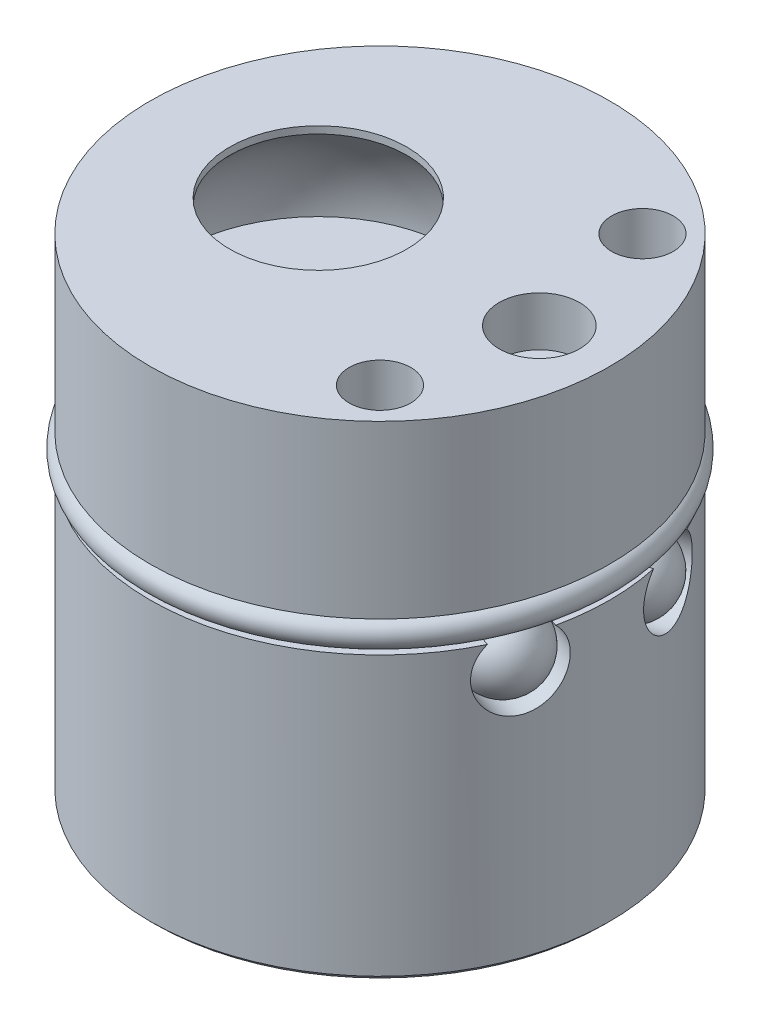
ISO-10303-21;
HEADER;
FILE_DESCRIPTION(('STEP AP214'),'2;1');
FILE_NAME('part.step','',(''),(''),'','','');
FILE_SCHEMA(('AUTOMOTIVE_DESIGN { 1 0 10303 214 1 1 1 1 }'));
ENDSEC;
DATA;
#1=APPLICATION_CONTEXT('core data for automotive mechanical design processes');
#2=APPLICATION_PROTOCOL_DEFINITION('international standard','automotive_design',2000,#1);
#3=PRODUCT_CONTEXT('',#1,'mechanical');
#4=PRODUCT('Part','Part','',(#3));
#5=PRODUCT_RELATED_PRODUCT_CATEGORY('part','',(#4));
#6=PRODUCT_DEFINITION_FORMATION('','',#4);
#7=PRODUCT_DEFINITION_CONTEXT('part definition',#1,'design');
#8=PRODUCT_DEFINITION('design','',#6,#7);
#9=PRODUCT_DEFINITION_SHAPE('','',#8);
#10=(LENGTH_UNIT() NAMED_UNIT(*) SI_UNIT(.MILLI.,.METRE.));
#11=(NAMED_UNIT(*) PLANE_ANGLE_UNIT() SI_UNIT($,.RADIAN.));
#12=(NAMED_UNIT(*) SI_UNIT($,.STERADIAN.) SOLID_ANGLE_UNIT());
#13=UNCERTAINTY_MEASURE_WITH_UNIT(LENGTH_MEASURE(1.E-05),#10,'distance_accuracy_value','');
#14=(GEOMETRIC_REPRESENTATION_CONTEXT(3) GLOBAL_UNCERTAINTY_ASSIGNED_CONTEXT((#13)) GLOBAL_UNIT_ASSIGNED_CONTEXT((#10,
#11,#12)) REPRESENTATION_CONTEXT('',''));
#15=CARTESIAN_POINT('',(0.,0.,0.));
#16=DIRECTION('',(0.,0.,1.));
#17=DIRECTION('',(1.,0.,0.));
#18=AXIS2_PLACEMENT_3D('',#15,#16,#17);
#19=CARTESIAN_POINT('',(0.,15.4305,0.));
#20=DIRECTION('',(0.,1.,0.));
#21=DIRECTION('',(0.,0.,-1.));
#22=AXIS2_PLACEMENT_3D('',#19,#20,#21);
#23=TOROIDAL_SURFACE('',#22,11.3792,0.7493);
#24=CARTESIAN_POINT('',(10.2380761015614,14.9959977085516,-3.33880438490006));
#25=CARTESIAN_POINT('',(10.2138890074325,15.003076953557,-3.39670465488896));
#26=CARTESIAN_POINT('',(10.1916967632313,15.0063272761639,-3.45595878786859));
#27=CARTESIAN_POINT('',(10.1510197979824,15.0053097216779,-3.57577510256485));
#28=CARTESIAN_POINT('',(10.1325421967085,15.0010275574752,-3.63633955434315));
#29=CARTESIAN_POINT('',(10.1059283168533,14.9874049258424,-3.73775640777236));
#30=CARTESIAN_POINT('',(10.0963903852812,14.9801947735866,-3.77853179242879));
#31=CARTESIAN_POINT('',(10.0805679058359,14.9621173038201,-3.85991351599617));
#32=CARTESIAN_POINT('',(10.0742788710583,14.9512550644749,-3.90052001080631));
#33=CARTESIAN_POINT('',(10.0680821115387,14.9301060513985,-3.96691187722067));
#34=CARTESIAN_POINT('',(10.0667121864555,14.9209454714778,-3.99291618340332));
#35=CARTESIAN_POINT('',(10.0669985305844,14.900887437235,-4.0442524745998));
#36=CARTESIAN_POINT('',(10.0686493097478,14.8899931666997,-4.06958559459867));
#37=CARTESIAN_POINT('',(10.0748047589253,14.8711954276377,-4.10889379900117));
#38=CARTESIAN_POINT('',(10.0778989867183,14.8638452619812,-4.12334860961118));
#39=CARTESIAN_POINT('',(10.086095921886,14.8485691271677,-4.15138654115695));
#40=CARTESIAN_POINT('',(10.0911974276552,14.8406435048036,-4.16497017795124));
#41=CARTESIAN_POINT('',(10.1023480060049,14.826337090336,-4.18758254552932));
#42=CARTESIAN_POINT('',(10.1078736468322,14.8200434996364,-4.19692077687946));
#43=CARTESIAN_POINT('',(10.1205153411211,14.8073740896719,-4.21436101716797));
#44=CARTESIAN_POINT('',(10.1276262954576,14.8009985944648,-4.22246685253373));
#45=CARTESIAN_POINT('',(10.1422360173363,14.7893706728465,-4.23587656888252));
#46=CARTESIAN_POINT('',(10.1494978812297,14.7840993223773,-4.24142062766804));
#47=CARTESIAN_POINT('',(10.1650791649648,14.7738181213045,-4.25108240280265));
#48=CARTESIAN_POINT('',(10.1733979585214,14.768808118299,-4.25520095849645));
#49=CARTESIAN_POINT('',(10.1908703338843,14.7592068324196,-4.26186053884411));
#50=CARTESIAN_POINT('',(10.2000242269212,14.7546157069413,-4.26440097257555));
#51=CARTESIAN_POINT('',(10.2188672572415,14.7459602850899,-4.26789467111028));
#52=CARTESIAN_POINT('',(10.2285567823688,14.7418963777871,-4.26884676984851));
#53=CARTESIAN_POINT('',(10.250822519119,14.7333165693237,-4.26933424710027));
#54=CARTESIAN_POINT('',(10.2634740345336,14.7289732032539,-4.26841957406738));
#55=CARTESIAN_POINT('',(10.2887499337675,14.7211388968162,-4.26459339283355));
#56=CARTESIAN_POINT('',(10.3013741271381,14.7176505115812,-4.26167599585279));
#57=CARTESIAN_POINT('',(10.3326223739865,14.7098323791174,-4.2523523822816));
#58=CARTESIAN_POINT('',(10.3510548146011,14.7059681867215,-4.24492815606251));
#59=CARTESIAN_POINT('',(10.386858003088,14.6994663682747,-4.22747697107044));
#60=CARTESIAN_POINT('',(10.4042261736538,14.6968316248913,-4.21744398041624));
#61=CARTESIAN_POINT('',(10.4500643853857,14.6908226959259,-4.18746295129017));
#62=CARTESIAN_POINT('',(10.4773980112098,14.6883095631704,-4.16561862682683));
#63=CARTESIAN_POINT('',(10.5287786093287,14.6846776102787,-4.11829109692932));
#64=CARTESIAN_POINT('',(10.5528174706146,14.6835621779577,-4.09279921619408));
#65=CARTESIAN_POINT('',(10.5941691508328,14.6821873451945,-4.04359213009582));
#66=CARTESIAN_POINT('',(10.6119402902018,14.6818183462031,-4.02026067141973));
#67=CARTESIAN_POINT('',(10.6454431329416,14.6813555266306,-3.97216713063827));
#68=CARTESIAN_POINT('',(10.6611735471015,14.6812618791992,-3.94740415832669));
#69=CARTESIAN_POINT('',(10.7054403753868,14.681139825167,-3.87135002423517));
#70=CARTESIAN_POINT('',(10.7310325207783,14.6812705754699,-3.81831812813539));
#71=CARTESIAN_POINT('',(10.7754252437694,14.6813647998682,-3.70673123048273));
#72=CARTESIAN_POINT('',(10.7938638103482,14.6813203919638,-3.64803471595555));
#73=CARTESIAN_POINT('',(10.8216635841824,14.6811800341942,-3.52857142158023));
#74=CARTESIAN_POINT('',(10.8310437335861,14.6810841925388,-3.46780923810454));
#75=CARTESIAN_POINT('',(10.8374750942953,14.6817407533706,-3.37103759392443));
#76=CARTESIAN_POINT('',(10.8380316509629,14.6821569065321,-3.33524511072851));
#77=CARTESIAN_POINT('',(10.8349133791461,14.683791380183,-3.2638208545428));
#78=CARTESIAN_POINT('',(10.8312405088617,14.6850093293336,-3.22818901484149));
#79=CARTESIAN_POINT('',(10.8204846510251,14.6884426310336,-3.16782934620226));
#80=CARTESIAN_POINT('',(10.8146550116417,14.6902799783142,-3.1428595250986));
#81=CARTESIAN_POINT('',(10.7997864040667,14.6952217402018,-3.09401040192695));
#82=CARTESIAN_POINT('',(10.7907548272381,14.6983232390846,-3.07012873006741));
#83=CARTESIAN_POINT('',(10.7732279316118,14.7048277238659,-3.03379127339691));
#84=CARTESIAN_POINT('',(10.7659920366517,14.7076018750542,-3.0206196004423));
#85=CARTESIAN_POINT('',(10.7499612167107,14.7140394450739,-2.99547243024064));
#86=CARTESIAN_POINT('',(10.7411672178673,14.7177023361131,-2.98349622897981));
#87=CARTESIAN_POINT('',(10.7239615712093,14.7252194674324,-2.9637040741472));
#88=CARTESIAN_POINT('',(10.7158611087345,14.7288700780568,-2.95554359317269));
#89=CARTESIAN_POINT('',(10.6986876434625,14.7368984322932,-2.94077364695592));
#90=CARTESIAN_POINT('',(10.6896173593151,14.7412741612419,-2.93416000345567));
#91=CARTESIAN_POINT('',(10.6705603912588,14.7507946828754,-2.9228233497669));
#92=CARTESIAN_POINT('',(10.660565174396,14.7559469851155,-2.91812067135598));
#93=CARTESIAN_POINT('',(10.6400896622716,14.7668452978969,-2.91103417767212));
#94=CARTESIAN_POINT('',(10.6296096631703,14.7725909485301,-2.9086489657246));
#95=CARTESIAN_POINT('',(10.610095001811,14.7835837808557,-2.90641855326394));
#96=CARTESIAN_POINT('',(10.6010677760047,14.7887848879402,-2.90625912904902));
#97=CARTESIAN_POINT('',(10.5831787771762,14.7992908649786,-2.90754660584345));
#98=CARTESIAN_POINT('',(10.5743173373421,14.8045959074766,-2.90899644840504));
#99=CARTESIAN_POINT('',(10.5408880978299,14.8249114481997,-2.91727095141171));
#100=CARTESIAN_POINT('',(10.5174698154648,14.8397913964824,-2.92907678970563));
#101=CARTESIAN_POINT('',(10.4782585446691,14.8650013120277,-2.95622582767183));
#102=CARTESIAN_POINT('',(10.4618535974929,14.8756663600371,-2.97053297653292));
#103=CARTESIAN_POINT('',(10.4308426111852,14.8956932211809,-3.00186797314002));
#104=CARTESIAN_POINT('',(10.4162421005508,14.9050510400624,-3.01890383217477));
#105=CARTESIAN_POINT('',(10.3892277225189,14.9219910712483,-3.05386457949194));
#106=CARTESIAN_POINT('',(10.3767417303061,14.9296378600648,-3.07170488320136));
#107=CARTESIAN_POINT('',(10.3528403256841,14.9437731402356,-3.10853382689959));
#108=CARTESIAN_POINT('',(10.3414257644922,14.9502607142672,-3.12752336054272));
#109=CARTESIAN_POINT('',(10.3084911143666,14.9680421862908,-3.18571671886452));
#110=CARTESIAN_POINT('',(10.2882591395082,14.9776682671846,-3.22617450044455));
#111=CARTESIAN_POINT('',(10.2638810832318,14.987328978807,-3.27926388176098));
#112=CARTESIAN_POINT('',(10.2585868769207,14.989297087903,-3.29108433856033));
#113=CARTESIAN_POINT('',(10.2481919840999,14.9928974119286,-3.31485198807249));
#114=CARTESIAN_POINT('',(10.2430911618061,14.9945298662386,-3.32679908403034));
#115=CARTESIAN_POINT('',(10.2380761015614,14.9959977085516,-3.33880438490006));
#116=B_SPLINE_CURVE_WITH_KNOTS('',3,(#24,#25,#26,#27,#28,#29,#30,#31,#32,#33,#34,#35,#36,#37,
#38,#39,#40,#41,#42,#43,#44,#45,#46,#47,#48,#49,#50,#51,#52,#53,#54,#55,#56,#57,#58,#59,#60,#61,
#62,#63,#64,#65,#66,#67,#68,#69,#70,#71,#72,#73,#74,#75,#76,#77,#78,#79,#80,#81,#82,#83,#84,#85,
#86,#87,#88,#89,#90,#91,#92,#93,#94,#95,#96,#97,#98,#99,#100,#101,#102,#103,#104,#105,#106,#107,
#108,#109,#110,#111,#112,#113,#114,#115),.UNSPECIFIED.,.T.,.F.,(4,2,2,2,2,2,2,2,2,2,2,2,2,2,2,2,
2,2,2,2,2,2,2,2,2,2,2,2,2,2,2,2,2,2,2,2,2,2,2,2,2,2,2,2,2,4),(0.,0.189410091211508,
0.379179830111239,0.506452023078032,0.633547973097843,0.71621494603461,0.798731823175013,
0.848147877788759,0.897534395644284,0.935036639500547,0.972419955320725,1.00392355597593,
1.03540857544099,1.0669053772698,1.09842529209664,1.13842502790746,1.17854288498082,
1.23893247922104,1.29946296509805,1.40411813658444,1.5090264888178,1.5968983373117,
1.6848254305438,1.86077311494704,2.04472666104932,2.22829470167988,2.33550662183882,
2.44266892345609,2.51961900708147,2.59639260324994,2.64212725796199,2.68783481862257,
2.72389336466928,2.75985335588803,2.79618651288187,2.8324977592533,2.86362085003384,
2.89480092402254,2.98344061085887,3.05593436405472,3.12864499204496,3.1977894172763,
3.26698831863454,3.40527218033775,3.44457344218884,3.4838465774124),.UNSPECIFIED.);
#117=CARTESIAN_POINT('',(10.2380761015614,14.9959977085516,-3.33880438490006));
#118=VERTEX_POINT('',#117);
#119=EDGE_CURVE('E21',#118,#118,#116,.T.);
#120=ORIENTED_EDGE('',*,*,#119,.F.);
#121=EDGE_LOOP('',(#120));
#122=FACE_BOUND('',#121,.T.);
#123=CARTESIAN_POINT('',(10.1772137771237,15.0058619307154,3.49878927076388));
#124=CARTESIAN_POINT('',(10.1979550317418,15.0056539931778,3.43889760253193));
#125=CARTESIAN_POINT('',(10.2205553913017,15.001668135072,3.37966234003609));
#126=CARTESIAN_POINT('',(10.2575614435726,14.9898839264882,3.2929681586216));
#127=CARTESIAN_POINT('',(10.2704130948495,14.9849889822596,3.26443233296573));
#128=CARTESIAN_POINT('',(10.2973763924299,14.9731972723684,3.20839403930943));
#129=CARTESIAN_POINT('',(10.3114872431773,14.9663017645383,3.18089093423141));
#130=CARTESIAN_POINT('',(10.3428370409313,14.9496038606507,3.12463249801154));
#131=CARTESIAN_POINT('',(10.3602484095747,14.9395756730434,3.09603859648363));
#132=CARTESIAN_POINT('',(10.3977000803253,14.9168290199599,3.04182001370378));
#133=CARTESIAN_POINT('',(10.4177299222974,14.9041211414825,3.01618424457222));
#134=CARTESIAN_POINT('',(10.4500949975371,14.8832720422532,2.98211363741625));
#135=CARTESIAN_POINT('',(10.4610020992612,14.8762010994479,2.97167578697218));
#136=CARTESIAN_POINT('',(10.4838277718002,14.861431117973,2.95243063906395));
#137=CARTESIAN_POINT('',(10.4957465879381,14.853731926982,2.94362373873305));
#138=CARTESIAN_POINT('',(10.5186941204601,14.8390670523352,2.9295051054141));
#139=CARTESIAN_POINT('',(10.5295642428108,14.8321786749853,2.92386057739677));
#140=CARTESIAN_POINT('',(10.5520136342,14.8181771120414,2.91471499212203));
#141=CARTESIAN_POINT('',(10.5635901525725,14.811064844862,2.91120613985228));
#142=CARTESIAN_POINT('',(10.5845425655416,14.7984815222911,2.90736722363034));
#143=CARTESIAN_POINT('',(10.5938152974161,14.793007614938,2.9064932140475));
#144=CARTESIAN_POINT('',(10.6124579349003,14.7822349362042,2.90654631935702));
#145=CARTESIAN_POINT('',(10.621827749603,14.7769360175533,2.9074718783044));
#146=CARTESIAN_POINT('',(10.6404189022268,14.7666778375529,2.91120618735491));
#147=CARTESIAN_POINT('',(10.6496396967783,14.761719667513,2.91402070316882));
#148=CARTESIAN_POINT('',(10.6676114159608,14.7523122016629,2.92142379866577));
#149=CARTESIAN_POINT('',(10.6763621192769,14.7478631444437,2.92601320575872));
#150=CARTESIAN_POINT('',(10.7009763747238,14.7356995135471,2.94170689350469));
#151=CARTESIAN_POINT('',(10.7159145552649,14.7287805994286,2.95490681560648));
#152=CARTESIAN_POINT('',(10.7401520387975,14.7181148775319,2.98201644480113));
#153=CARTESIAN_POINT('',(10.7499828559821,14.714019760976,2.99535831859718));
#154=CARTESIAN_POINT('',(10.7677459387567,14.7069096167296,3.02353417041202));
#155=CARTESIAN_POINT('',(10.7756739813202,14.7038969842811,3.0383713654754));
#156=CARTESIAN_POINT('',(10.7944890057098,14.6969932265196,3.0790353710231));
#157=CARTESIAN_POINT('',(10.8038847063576,14.6938307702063,3.10566285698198));
#158=CARTESIAN_POINT('',(10.8189329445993,14.6889078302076,3.16005658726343));
#159=CARTESIAN_POINT('',(10.8245772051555,14.6871504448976,3.18782520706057));
#160=CARTESIAN_POINT('',(10.8322496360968,14.6846620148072,3.24034510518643));
#161=CARTESIAN_POINT('',(10.8346407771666,14.683830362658,3.26504117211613));
#162=CARTESIAN_POINT('',(10.8373471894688,14.6825859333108,3.31455963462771));
#163=CARTESIAN_POINT('',(10.8376613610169,14.682173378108,3.3393820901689));
#164=CARTESIAN_POINT('',(10.8358279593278,14.6813008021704,3.41384943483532));
#165=CARTESIAN_POINT('',(10.8308973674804,14.6812076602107,3.46343713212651));
#166=CARTESIAN_POINT('',(10.8117421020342,14.6811901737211,3.57984864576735));
#167=CARTESIAN_POINT('',(10.7947373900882,14.6813417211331,3.64620478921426));
#168=CARTESIAN_POINT('',(10.7501312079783,14.6813363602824,3.77526680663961));
#169=CARTESIAN_POINT('',(10.7225316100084,14.6811795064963,3.83797332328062));
#170=CARTESIAN_POINT('',(10.6672202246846,14.6812153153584,3.93860126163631));
#171=CARTESIAN_POINT('',(10.6423155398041,14.6813129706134,3.97807987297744));
#172=CARTESIAN_POINT('',(10.5873194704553,14.6823049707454,4.05320453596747));
#173=CARTESIAN_POINT('',(10.5572428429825,14.6831970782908,4.08886103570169));
#174=CARTESIAN_POINT('',(10.5064458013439,14.6861707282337,4.13940211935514));
#175=CARTESIAN_POINT('',(10.4877209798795,14.6875234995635,4.15633921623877));
#176=CARTESIAN_POINT('',(10.4484775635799,14.69120633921,4.18792319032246));
#177=CARTESIAN_POINT('',(10.427959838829,14.6935359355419,4.20257116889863));
#178=CARTESIAN_POINT('',(10.3908126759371,14.6988835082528,4.22516673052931));
#179=CARTESIAN_POINT('',(10.3745921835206,14.7015558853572,4.23386149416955));
#180=CARTESIAN_POINT('',(10.3412875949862,14.7080142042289,4.24888613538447));
#181=CARTESIAN_POINT('',(10.324205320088,14.7117978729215,4.25522078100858));
#182=CARTESIAN_POINT('',(10.295113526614,14.7193704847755,4.26315218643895));
#183=CARTESIAN_POINT('',(10.2832415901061,14.7227654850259,4.26561772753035));
#184=CARTESIAN_POINT('',(10.2595119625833,14.7303211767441,4.26873614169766));
#185=CARTESIAN_POINT('',(10.2476543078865,14.7344799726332,4.26939343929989));
#186=CARTESIAN_POINT('',(10.2260930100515,14.7429064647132,4.2686568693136));
#187=CARTESIAN_POINT('',(10.2163361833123,14.7470612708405,4.26755993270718));
#188=CARTESIAN_POINT('',(10.1973985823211,14.7559025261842,4.26373785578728));
#189=CARTESIAN_POINT('',(10.1882174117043,14.7605886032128,4.26101384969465));
#190=CARTESIAN_POINT('',(10.1707201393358,14.7703828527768,4.25395700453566));
#191=CARTESIAN_POINT('',(10.1624053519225,14.7754916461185,4.24962176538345));
#192=CARTESIAN_POINT('',(10.14687706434,14.7859567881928,4.23951695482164));
#193=CARTESIAN_POINT('',(10.1396642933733,14.7913132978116,4.23374644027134));
#194=CARTESIAN_POINT('',(10.1249532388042,14.8033071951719,4.21961318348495));
#195=CARTESIAN_POINT('',(10.1177515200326,14.8099632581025,4.2109593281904));
#196=CARTESIAN_POINT('',(10.1050524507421,14.8231537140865,4.19238546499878));
#197=CARTESIAN_POINT('',(10.0995600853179,14.8296876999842,4.18246187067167));
#198=CARTESIAN_POINT('',(10.0876514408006,14.8457583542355,4.15644988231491));
#199=CARTESIAN_POINT('',(10.0822076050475,14.8551150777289,4.13981137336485));
#200=CARTESIAN_POINT('',(10.0739702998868,14.8729751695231,4.10546665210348));
#201=CARTESIAN_POINT('',(10.0711834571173,14.8814763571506,4.08775788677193));
#202=CARTESIAN_POINT('',(10.0677800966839,14.8968578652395,4.05335025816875));
#203=CARTESIAN_POINT('',(10.0669932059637,14.903815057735,4.03670087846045));
#204=CARTESIAN_POINT('',(10.0667350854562,14.9169881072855,4.0030989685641));
#205=CARTESIAN_POINT('',(10.0672647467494,14.9232034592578,3.98614624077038));
#206=CARTESIAN_POINT('',(10.0704169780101,14.9407856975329,3.93496011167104));
#207=CARTESIAN_POINT('',(10.0746058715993,14.9510670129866,3.90044847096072));
#208=CARTESIAN_POINT('',(10.0851057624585,14.9678609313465,3.835245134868));
#209=CARTESIAN_POINT('',(10.0911138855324,14.9746725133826,3.80457518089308));
#210=CARTESIAN_POINT('',(10.1047585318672,14.9862643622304,3.74319731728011));
#211=CARTESIAN_POINT('',(10.1123961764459,14.9910432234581,3.7124893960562));
#212=CARTESIAN_POINT('',(10.1372015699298,15.0024259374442,3.62047646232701));
#213=CARTESIAN_POINT('',(10.1562588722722,15.0060720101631,3.55929786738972));
#214=CARTESIAN_POINT('',(10.1772137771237,15.0058619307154,3.49878927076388));
#215=B_SPLINE_CURVE_WITH_KNOTS('',3,(#123,#124,#125,#126,#127,#128,#129,#130,#131,#132,#133,
#134,#135,#136,#137,#138,#139,#140,#141,#142,#143,#144,#145,#146,#147,#148,#149,#150,#151,#152,
#153,#154,#155,#156,#157,#158,#159,#160,#161,#162,#163,#164,#165,#166,#167,#168,#169,#170,#171,
#172,#173,#174,#175,#176,#177,#178,#179,#180,#181,#182,#183,#184,#185,#186,#187,#188,#189,#190,
#191,#192,#193,#194,#195,#196,#197,#198,#199,#200,#201,#202,#203,#204,#205,#206,#207,#208,#209,
#210,#211,#212,#213,#214),.UNSPECIFIED.,.T.,.F.,(4,2,2,2,2,2,2,2,2,2,2,2,2,2,2,2,2,2,2,2,2,2,2,
2,2,2,2,2,2,2,2,2,2,2,2,2,2,2,2,2,2,2,2,2,2,4),(0.,0.189931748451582,0.284880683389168,
0.379770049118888,0.484403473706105,0.588631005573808,0.63855518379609,0.688491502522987,
0.730508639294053,0.772371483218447,0.80464744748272,0.836895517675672,0.869242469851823,
0.901604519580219,0.963963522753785,1.01495716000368,1.06606294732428,1.15083532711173,
1.23579413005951,1.310165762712,1.38457676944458,1.53356976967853,1.73811949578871,
1.94263309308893,2.08233815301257,2.22165101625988,2.29737549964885,2.37306343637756,
2.42871049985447,2.48424452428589,2.52189798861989,2.55945923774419,2.59130427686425,
2.62312714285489,2.6549976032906,2.68688906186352,2.72590915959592,2.76504201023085,
2.8242582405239,2.88362177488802,2.93772715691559,2.9918691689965,3.10031458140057,
3.19616825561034,3.29208810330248,3.48397628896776),.UNSPECIFIED.);
#216=CARTESIAN_POINT('',(10.1772137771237,15.0058619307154,3.49878927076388));
#217=VERTEX_POINT('',#216);
#218=EDGE_CURVE('E61',#217,#217,#215,.T.);
#219=ORIENTED_EDGE('',*,*,#218,.F.);
#220=EDGE_LOOP('',(#219));
#221=FACE_BOUND('',#220,.T.);
#222=ADVANCED_FACE('F16',(#122,#221),#23,.T.);
#223=CARTESIAN_POINT('',(9.63048489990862,13.1064,-3.31604188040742));
#224=DIRECTION('',(-0.325568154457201,0.,-0.945518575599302));
#225=DIRECTION('',(-0.945518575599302,0.,0.325568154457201));
#226=AXIS2_PLACEMENT_3D('',#223,#224,#225);
#227=SPHERICAL_SURFACE('',#226,1.98501);
#228=ORIENTED_EDGE('',*,*,#119,.T.);
#229=EDGE_LOOP('',(#228));
#230=FACE_BOUND('',#229,.T.);
#231=CARTESIAN_POINT('',(9.63048489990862,15.09141,-3.31604188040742));
#232=CARTESIAN_POINT('',(9.64866715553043,15.0914096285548,-3.26323677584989));
#233=CARTESIAN_POINT('',(9.6668407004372,15.0890516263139,-3.21045696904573));
#234=CARTESIAN_POINT('',(9.70305774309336,15.0796445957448,-3.10527503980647));
#235=CARTESIAN_POINT('',(9.72110124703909,15.0725957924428,-3.0528728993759));
#236=CARTESIAN_POINT('',(9.77481127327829,15.0444801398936,-2.89688765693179));
#237=CARTESIAN_POINT('',(9.81011802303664,15.0164438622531,-2.79434941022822));
#238=CARTESIAN_POINT('',(9.87869697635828,14.9425635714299,-2.59518166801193));
#239=CARTESIAN_POINT('',(9.91196819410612,14.8967110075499,-2.49855503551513));
#240=CARTESIAN_POINT('',(9.97553121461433,14.7885045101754,-2.31395461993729));
#241=CARTESIAN_POINT('',(10.0058235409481,14.7261534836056,-2.22597931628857));
#242=CARTESIAN_POINT('',(10.0625689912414,14.5867190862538,-2.06117856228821));
#243=CARTESIAN_POINT('',(10.089022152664,14.5096358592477,-1.98435300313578));
#244=CARTESIAN_POINT('',(10.1373454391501,14.3429040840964,-1.8440119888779));
#245=CARTESIAN_POINT('',(10.1592146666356,14.2532530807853,-1.78049914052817));
#246=CARTESIAN_POINT('',(10.1977453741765,14.0639374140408,-1.66859784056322));
#247=CARTESIAN_POINT('',(10.2144058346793,13.9642707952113,-1.62021234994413));
#248=CARTESIAN_POINT('',(10.242034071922,13.7577804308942,-1.53997412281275));
#249=CARTESIAN_POINT('',(10.2530051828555,13.6509609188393,-1.50811170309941));
#250=CARTESIAN_POINT('',(10.2662167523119,13.47063977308,-1.46974251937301));
#251=CARTESIAN_POINT('',(10.2701609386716,13.3982724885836,-1.45828777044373));
#252=CARTESIAN_POINT('',(10.2754226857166,13.2527469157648,-1.44300654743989));
#253=CARTESIAN_POINT('',(10.2767439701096,13.179589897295,-1.43916925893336));
#254=CARTESIAN_POINT('',(10.2767409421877,13.1064,-1.43917805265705));
#255=B_SPLINE_CURVE_WITH_KNOTS('',3,(#231,#232,#233,#234,#235,#236,#237,#238,#239,#240,#241,
#242,#243,#244,#245,#246,#247,#248,#249,#250,#251,#252,#253,#254),.UNSPECIFIED.,.F.,.F.,(4,2,2,
2,2,2,2,2,2,2,2,4),(0.,0.167440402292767,0.334872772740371,0.669185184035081,1.00365824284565,
1.33807240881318,1.67248331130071,2.00695963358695,2.34150138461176,2.67584685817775,
2.89555223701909,3.11494547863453),.UNSPECIFIED.);
#256=CARTESIAN_POINT('',(9.63048489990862,15.09141,-3.31604188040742));
#257=VERTEX_POINT('',#256);
#258=CARTESIAN_POINT('',(10.2767409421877,13.1064,-1.43917805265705));
#259=VERTEX_POINT('',#258);
#260=EDGE_CURVE('E72',#257,#259,#255,.T.);
#261=ORIENTED_EDGE('',*,*,#260,.T.);
#262=CARTESIAN_POINT('',(9.63048489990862,13.1064,-3.31604188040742));
#263=DIRECTION('',(-0.945518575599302,0.,0.325568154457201));
#264=DIRECTION('',(-0.325568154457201,0.,-0.945518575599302));
#265=AXIS2_PLACEMENT_3D('',#262,#263,#264);
#266=CIRCLE('',#265,1.98501);
#267=CARTESIAN_POINT('',(9.63048489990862,11.12139,-3.31604188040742));
#268=VERTEX_POINT('',#267);
#269=EDGE_CURVE('E241',#259,#268,#266,.F.);
#270=ORIENTED_EDGE('',*,*,#269,.T.);
#271=CARTESIAN_POINT('',(9.63048489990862,11.12139,-3.31604188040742));
#272=CARTESIAN_POINT('',(9.61230264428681,11.1213903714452,-3.36884698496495));
#273=CARTESIAN_POINT('',(9.59412909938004,11.1237483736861,-3.42162679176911));
#274=CARTESIAN_POINT('',(9.55791205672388,11.1331554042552,-3.52680872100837));
#275=CARTESIAN_POINT('',(9.53986855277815,11.1402042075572,-3.57921086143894));
#276=CARTESIAN_POINT('',(9.48615852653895,11.1683198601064,-3.73519610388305));
#277=CARTESIAN_POINT('',(9.4508517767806,11.1963561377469,-3.83773435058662));
#278=CARTESIAN_POINT('',(9.38227282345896,11.2702364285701,-4.03690209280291));
#279=CARTESIAN_POINT('',(9.34900160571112,11.3160889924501,-4.13352872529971));
#280=CARTESIAN_POINT('',(9.28543858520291,11.4242954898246,-4.31812914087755));
#281=CARTESIAN_POINT('',(9.25514625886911,11.4866465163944,-4.40610444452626));
#282=CARTESIAN_POINT('',(9.19840080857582,11.6260809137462,-4.57090519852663));
#283=CARTESIAN_POINT('',(9.17194764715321,11.7031641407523,-4.64773075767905));
#284=CARTESIAN_POINT('',(9.12362436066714,11.8698959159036,-4.78807177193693));
#285=CARTESIAN_POINT('',(9.10175513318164,11.9595469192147,-4.85158462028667));
#286=CARTESIAN_POINT('',(9.0632244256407,12.1488625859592,-4.96348592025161));
#287=CARTESIAN_POINT('',(9.04656396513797,12.2485292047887,-5.0118714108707));
#288=CARTESIAN_POINT('',(9.01893572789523,12.4550195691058,-5.09210963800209));
#289=CARTESIAN_POINT('',(9.0079646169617,12.5618390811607,-5.12397205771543));
#290=CARTESIAN_POINT('',(8.99475304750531,12.74216022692,-5.16234124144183));
#291=CARTESIAN_POINT('',(8.99080886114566,12.8145275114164,-5.17379599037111));
#292=CARTESIAN_POINT('',(8.9855471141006,12.9600530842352,-5.18907721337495));
#293=CARTESIAN_POINT('',(8.98422582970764,13.033210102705,-5.19291450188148));
#294=CARTESIAN_POINT('',(8.98422885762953,13.1064,-5.19290570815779));
#295=B_SPLINE_CURVE_WITH_KNOTS('',3,(#271,#272,#273,#274,#275,#276,#277,#278,#279,#280,#281,
#282,#283,#284,#285,#286,#287,#288,#289,#290,#291,#292,#293,#294),.UNSPECIFIED.,.F.,.F.,(4,2,2,
2,2,2,2,2,2,2,2,4),(0.,0.167440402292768,0.334872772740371,0.66918518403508,1.00365824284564,
1.33807240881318,1.6724833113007,2.00695963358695,2.34150138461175,2.67584685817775,
2.89555223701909,3.11494547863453),.UNSPECIFIED.);
#296=CARTESIAN_POINT('',(8.98422885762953,13.1064,-5.19290570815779));
#297=VERTEX_POINT('',#296);
#298=EDGE_CURVE('E236',#268,#297,#295,.T.);
#299=ORIENTED_EDGE('',*,*,#298,.T.);
#300=CARTESIAN_POINT('',(9.63048489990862,13.1064,-3.31604188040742));
#301=DIRECTION('',(0.945518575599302,0.,-0.325568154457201));
#302=DIRECTION('',(-0.325568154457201,0.,-0.945518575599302));
#303=AXIS2_PLACEMENT_3D('',#300,#301,#302);
#304=CIRCLE('',#303,1.98501);
#305=EDGE_CURVE('E234',#297,#257,#304,.T.);
#306=ORIENTED_EDGE('',*,*,#305,.T.);
#307=EDGE_LOOP('',(#261,#270,#299,#306));
#308=FACE_BOUND('',#307,.T.);
#309=ADVANCED_FACE('F177',(#230,#308),#227,.T.);
#310=CARTESIAN_POINT('',(9.63048489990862,13.1064,-3.31604188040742));
#311=DIRECTION('',(-0.945518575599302,0.,0.325568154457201));
#312=DIRECTION('',(0.325568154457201,0.,0.945518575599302));
#313=AXIS2_PLACEMENT_3D('',#310,#311,#312);
#314=PLANE('',#313);
#315=ORIENTED_EDGE('',*,*,#260,.F.);
#316=ORIENTED_EDGE('',*,*,#305,.F.);
#317=ORIENTED_EDGE('',*,*,#298,.F.);
#318=ORIENTED_EDGE('',*,*,#269,.F.);
#319=EDGE_LOOP('',(#315,#316,#317,#318));
#320=FACE_BOUND('',#319,.T.);
#321=CARTESIAN_POINT('',(9.63048489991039,13.1064,-3.31604188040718));
#322=DIRECTION('',(-0.945518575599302,0.,0.325568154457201));
#323=DIRECTION('',(0.325568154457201,0.,0.945518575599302));
#324=AXIS2_PLACEMENT_3D('',#321,#322,#323);
#325=CIRCLE('',#324,2.0193);
#326=CARTESIAN_POINT('',(10.2879046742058,13.1064,-1.40675622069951));
#327=VERTEX_POINT('',#326);
#328=EDGE_CURVE('E231',#327,#327,#325,.F.);
#329=ORIENTED_EDGE('',*,*,#328,.T.);
#330=EDGE_LOOP('',(#329));
#331=FACE_BOUND('',#330,.T.);
#332=ADVANCED_FACE('F243',(#320,#331),#314,.F.);
#333=CARTESIAN_POINT('',(9.63048489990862,13.1064,3.31604188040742));
#334=DIRECTION('',(0.325568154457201,0.,-0.945518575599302));
#335=DIRECTION('',(-0.945518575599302,0.,-0.325568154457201));
#336=AXIS2_PLACEMENT_3D('',#333,#334,#335);
#337=SPHERICAL_SURFACE('',#336,1.98501);
#338=ORIENTED_EDGE('',*,*,#218,.T.);
#339=EDGE_LOOP('',(#338));
#340=FACE_BOUND('',#339,.T.);
#341=CARTESIAN_POINT('',(9.63048489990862,15.09141,3.31604188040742));
#342=CARTESIAN_POINT('',(9.61230264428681,15.0914096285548,3.36884698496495));
#343=CARTESIAN_POINT('',(9.59412909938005,15.0890516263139,3.42162679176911));
#344=CARTESIAN_POINT('',(9.55791205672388,15.0796445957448,3.52680872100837));
#345=CARTESIAN_POINT('',(9.53986855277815,15.0725957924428,3.57921086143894));
#346=CARTESIAN_POINT('',(9.48615852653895,15.0444801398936,3.73519610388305));
#347=CARTESIAN_POINT('',(9.4508517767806,15.0164438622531,3.83773435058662));
#348=CARTESIAN_POINT('',(9.38227282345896,14.9425635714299,4.03690209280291));
#349=CARTESIAN_POINT('',(9.34900160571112,14.8967110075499,4.13352872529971));
#350=CARTESIAN_POINT('',(9.28543858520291,14.7885045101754,4.31812914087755));
#351=CARTESIAN_POINT('',(9.25514625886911,14.7261534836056,4.40610444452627));
#352=CARTESIAN_POINT('',(9.19840080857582,14.5867190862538,4.57090519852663));
#353=CARTESIAN_POINT('',(9.17194764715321,14.5096358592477,4.64773075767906));
#354=CARTESIAN_POINT('',(9.12362436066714,14.3429040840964,4.78807177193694));
#355=CARTESIAN_POINT('',(9.10175513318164,14.2532530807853,4.85158462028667));
#356=CARTESIAN_POINT('',(9.0632244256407,14.0639374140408,4.96348592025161));
#357=CARTESIAN_POINT('',(9.04656396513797,13.9642707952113,5.0118714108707));
#358=CARTESIAN_POINT('',(9.01893572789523,13.7577804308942,5.09210963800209));
#359=CARTESIAN_POINT('',(9.0079646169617,13.6509609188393,5.12397205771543));
#360=CARTESIAN_POINT('',(8.99475304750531,13.47063977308,5.16234124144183));
#361=CARTESIAN_POINT('',(8.99080886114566,13.3982724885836,5.17379599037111));
#362=CARTESIAN_POINT('',(8.9855471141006,13.2527469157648,5.18907721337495));
#363=CARTESIAN_POINT('',(8.98422582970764,13.179589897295,5.19291450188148));
#364=CARTESIAN_POINT('',(8.98422885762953,13.1064,5.19290570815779));
#365=B_SPLINE_CURVE_WITH_KNOTS('',3,(#341,#342,#343,#344,#345,#346,#347,#348,#349,#350,#351,
#352,#353,#354,#355,#356,#357,#358,#359,#360,#361,#362,#363,#364),.UNSPECIFIED.,.F.,.F.,(4,2,2,
2,2,2,2,2,2,2,2,4),(0.,0.167440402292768,0.334872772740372,0.669185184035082,1.00365824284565,
1.33807240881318,1.67248331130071,2.00695963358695,2.34150138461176,2.67584685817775,
2.89555223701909,3.11494547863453),.UNSPECIFIED.);
#366=CARTESIAN_POINT('',(9.63048489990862,15.09141,3.31604188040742));
#367=VERTEX_POINT('',#366);
#368=CARTESIAN_POINT('',(8.98422885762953,13.1064,5.19290570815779));
#369=VERTEX_POINT('',#368);
#370=EDGE_CURVE('E226',#367,#369,#365,.T.);
#371=ORIENTED_EDGE('',*,*,#370,.T.);
#372=CARTESIAN_POINT('',(9.63048489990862,13.1064,3.31604188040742));
#373=DIRECTION('',(-0.945518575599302,0.,-0.325568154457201));
#374=DIRECTION('',(0.325568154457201,0.,-0.945518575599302));
#375=AXIS2_PLACEMENT_3D('',#372,#373,#374);
#376=CIRCLE('',#375,1.98501);
#377=CARTESIAN_POINT('',(9.63048489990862,11.12139,3.31604188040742));
#378=VERTEX_POINT('',#377);
#379=EDGE_CURVE('E216',#369,#378,#376,.F.);
#380=ORIENTED_EDGE('',*,*,#379,.T.);
#381=CARTESIAN_POINT('',(9.63048489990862,11.12139,3.31604188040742));
#382=CARTESIAN_POINT('',(9.64866715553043,11.1213903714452,3.26323677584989));
#383=CARTESIAN_POINT('',(9.6668407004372,11.1237483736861,3.21045696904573));
#384=CARTESIAN_POINT('',(9.70305774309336,11.1331554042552,3.10527503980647));
#385=CARTESIAN_POINT('',(9.72110124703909,11.1402042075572,3.0528728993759));
#386=CARTESIAN_POINT('',(9.77481127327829,11.1683198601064,2.89688765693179));
#387=CARTESIAN_POINT('',(9.81011802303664,11.1963561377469,2.79434941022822));
#388=CARTESIAN_POINT('',(9.87869697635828,11.2702364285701,2.59518166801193));
#389=CARTESIAN_POINT('',(9.91196819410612,11.3160889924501,2.49855503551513));
#390=CARTESIAN_POINT('',(9.97553121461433,11.4242954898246,2.31395461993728));
#391=CARTESIAN_POINT('',(10.0058235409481,11.4866465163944,2.22597931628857));
#392=CARTESIAN_POINT('',(10.0625689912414,11.6260809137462,2.06117856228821));
#393=CARTESIAN_POINT('',(10.089022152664,11.7031641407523,1.98435300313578));
#394=CARTESIAN_POINT('',(10.1373454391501,11.8698959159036,1.8440119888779));
#395=CARTESIAN_POINT('',(10.1592146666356,11.9595469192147,1.78049914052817));
#396=CARTESIAN_POINT('',(10.1977453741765,12.1488625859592,1.66859784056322));
#397=CARTESIAN_POINT('',(10.2144058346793,12.2485292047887,1.62021234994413));
#398=CARTESIAN_POINT('',(10.242034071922,12.4550195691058,1.53997412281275));
#399=CARTESIAN_POINT('',(10.2530051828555,12.5618390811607,1.50811170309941));
#400=CARTESIAN_POINT('',(10.2662167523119,12.74216022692,1.46974251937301));
#401=CARTESIAN_POINT('',(10.2701609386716,12.8145275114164,1.45828777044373));
#402=CARTESIAN_POINT('',(10.2754226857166,12.9600530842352,1.44300654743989));
#403=CARTESIAN_POINT('',(10.2767439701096,13.033210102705,1.43916925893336));
#404=CARTESIAN_POINT('',(10.2767409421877,13.1064,1.43917805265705));
#405=B_SPLINE_CURVE_WITH_KNOTS('',3,(#381,#382,#383,#384,#385,#386,#387,#388,#389,#390,#391,
#392,#393,#394,#395,#396,#397,#398,#399,#400,#401,#402,#403,#404),.UNSPECIFIED.,.F.,.F.,(4,2,2,
2,2,2,2,2,2,2,2,4),(0.,0.167440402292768,0.334872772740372,0.669185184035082,1.00365824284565,
1.33807240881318,1.67248331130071,2.00695963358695,2.34150138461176,2.67584685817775,
2.89555223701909,3.11494547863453),.UNSPECIFIED.);
#406=CARTESIAN_POINT('',(10.2767409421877,13.1064,1.43917805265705));
#407=VERTEX_POINT('',#406);
#408=EDGE_CURVE('E210',#378,#407,#405,.T.);
#409=ORIENTED_EDGE('',*,*,#408,.T.);
#410=CARTESIAN_POINT('',(9.63048489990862,13.1064,3.31604188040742));
#411=DIRECTION('',(0.945518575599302,0.,0.325568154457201));
#412=DIRECTION('',(0.325568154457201,0.,-0.945518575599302));
#413=AXIS2_PLACEMENT_3D('',#410,#411,#412);
#414=CIRCLE('',#413,1.98501);
#415=EDGE_CURVE('E207',#407,#367,#414,.T.);
#416=ORIENTED_EDGE('',*,*,#415,.T.);
#417=EDGE_LOOP('',(#371,#380,#409,#416));
#418=FACE_BOUND('',#417,.T.);
#419=ADVANCED_FACE('F218',(#340,#418),#337,.T.);
#420=CARTESIAN_POINT('',(9.63048489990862,13.1064,3.31604188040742));
#421=DIRECTION('',(-0.945518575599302,0.,-0.325568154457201));
#422=DIRECTION('',(-0.325568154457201,0.,0.945518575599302));
#423=AXIS2_PLACEMENT_3D('',#420,#421,#422);
#424=PLANE('',#423);
#425=ORIENTED_EDGE('',*,*,#370,.F.);
#426=ORIENTED_EDGE('',*,*,#415,.F.);
#427=ORIENTED_EDGE('',*,*,#408,.F.);
#428=ORIENTED_EDGE('',*,*,#379,.F.);
#429=EDGE_LOOP('',(#425,#426,#427,#428));
#430=FACE_BOUND('',#429,.T.);
#431=CARTESIAN_POINT('',(9.63048489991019,13.1064,3.31604188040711));
#432=DIRECTION('',(-0.945518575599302,0.,-0.325568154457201));
#433=DIRECTION('',(-0.325568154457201,0.,0.945518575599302));
#434=AXIS2_PLACEMENT_3D('',#431,#432,#433);
#435=CIRCLE('',#434,2.0193);
#436=CARTESIAN_POINT('',(8.97306512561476,13.1064,5.22532754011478));
#437=VERTEX_POINT('',#436);
#438=EDGE_CURVE('E204',#437,#437,#435,.F.);
#439=ORIENTED_EDGE('',*,*,#438,.T.);
#440=EDGE_LOOP('',(#439));
#441=FACE_BOUND('',#440,.T.);
#442=ADVANCED_FACE('F221',(#430,#441),#424,.F.);
#443=CARTESIAN_POINT('',(11.1915360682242,13.1064,-3.8535549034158));
#444=DIRECTION('',(-0.945518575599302,0.,0.325568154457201));
#445=DIRECTION('',(0.325568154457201,0.,0.945518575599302));
#446=AXIS2_PLACEMENT_3D('',#443,#444,#445);
#447=CYLINDRICAL_SURFACE('',#446,2.0193);
#448=ORIENTED_EDGE('',*,*,#328,.F.);
#449=EDGE_LOOP('',(#448));
#450=FACE_BOUND('',#449,.T.);
#451=CARTESIAN_POINT('',(10.6654765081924,14.5795999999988,-5.13302793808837));
#452=CARTESIAN_POINT('',(10.6474239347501,14.5408407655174,-5.17053816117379));
#453=CARTESIAN_POINT('',(10.6298837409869,14.5003624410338,-5.20647669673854));
#454=CARTESIAN_POINT('',(10.5960280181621,14.4162089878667,-5.27503702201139));
#455=CARTESIAN_POINT('',(10.5797125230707,14.3725337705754,-5.30765871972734));
#456=CARTESIAN_POINT('',(10.5328811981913,14.2370110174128,-5.40033145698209));
#457=CARTESIAN_POINT('',(10.5045080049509,14.1407248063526,-5.45513376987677));
#458=CARTESIAN_POINT('',(10.4550684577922,13.9391079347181,-5.54930235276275));
#459=CARTESIAN_POINT('',(10.4340089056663,13.8337689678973,-5.58865425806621));
#460=CARTESIAN_POINT('',(10.400466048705,13.6172370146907,-5.65083474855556));
#461=CARTESIAN_POINT('',(10.3879602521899,13.5060602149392,-5.67370667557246));
#462=CARTESIAN_POINT('',(10.3767450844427,13.3460644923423,-5.69416904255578));
#463=CARTESIAN_POINT('',(10.3742388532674,13.2982930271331,-5.69873193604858));
#464=CARTESIAN_POINT('',(10.3708906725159,13.2024888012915,-5.70482280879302));
#465=CARTESIAN_POINT('',(10.370049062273,13.1544559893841,-5.70635016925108));
#466=CARTESIAN_POINT('',(10.3700549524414,12.9939494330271,-5.7063438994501));
#467=CARTESIAN_POINT('',(10.3746770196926,12.8813719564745,-5.69796607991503));
#468=CARTESIAN_POINT('',(10.3929141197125,12.6593179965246,-5.6646312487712));
#469=CARTESIAN_POINT('',(10.4065447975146,12.5498472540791,-5.63964539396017));
#470=CARTESIAN_POINT('',(10.4419905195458,12.3373434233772,-5.57374102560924));
#471=CARTESIAN_POINT('',(10.4637959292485,12.2343029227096,-5.53284126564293));
#472=CARTESIAN_POINT('',(10.5143711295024,12.0373956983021,-5.43611341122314));
#473=CARTESIAN_POINT('',(10.5431389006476,11.9435263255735,-5.3802896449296));
#474=CARTESIAN_POINT('',(10.6064287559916,11.7666147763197,-5.25442934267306));
#475=CARTESIAN_POINT('',(10.6410019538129,11.6836816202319,-5.18426523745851));
#476=CARTESIAN_POINT('',(10.7139839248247,11.53194319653,-5.03170451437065));
#477=CARTESIAN_POINT('',(10.7523930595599,11.4631392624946,-4.94930674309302));
#478=CARTESIAN_POINT('',(10.8314950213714,11.3412091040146,-4.77371929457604));
#479=CARTESIAN_POINT('',(10.8722006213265,11.2881835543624,-4.68046538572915));
#480=CARTESIAN_POINT('',(10.9538784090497,11.1999631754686,-4.48598070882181));
#481=CARTESIAN_POINT('',(10.9948505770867,11.1647670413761,-4.3847505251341));
#482=CARTESIAN_POINT('',(11.0750288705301,11.11353558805,-4.1780692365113));
#483=CARTESIAN_POINT('',(11.1142482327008,11.0973184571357,-4.07266835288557));
#484=CARTESIAN_POINT('',(11.1899844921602,11.0839398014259,-3.85971227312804));
#485=CARTESIAN_POINT('',(11.226501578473,11.086776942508,-3.7521572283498));
#486=CARTESIAN_POINT('',(11.2954519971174,11.1112848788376,-3.53914362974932));
#487=CARTESIAN_POINT('',(11.3279237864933,11.1327598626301,-3.43367490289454));
#488=CARTESIAN_POINT('',(11.3885926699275,11.1936256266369,-3.22675600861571));
#489=CARTESIAN_POINT('',(11.4167895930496,11.2330171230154,-3.12530600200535));
#490=CARTESIAN_POINT('',(11.468750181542,11.3287923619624,-2.92890983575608));
#491=CARTESIAN_POINT('',(11.4924918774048,11.3852569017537,-2.83399729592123));
#492=CARTESIAN_POINT('',(11.5353883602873,11.513511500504,-2.65400704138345));
#493=CARTESIAN_POINT('',(11.5545431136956,11.5853016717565,-2.56892939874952));
#494=CARTESIAN_POINT('',(11.5887119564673,11.7432403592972,-2.41014741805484));
#495=CARTESIAN_POINT('',(11.6036711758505,11.8295574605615,-2.33659888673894));
#496=CARTESIAN_POINT('',(11.6294992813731,12.0135825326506,-2.20446380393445));
#497=CARTESIAN_POINT('',(11.6403663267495,12.1112956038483,-2.14588398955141));
#498=CARTESIAN_POINT('',(11.6584154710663,12.3155617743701,-2.04556285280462));
#499=CARTESIAN_POINT('',(11.6655901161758,12.422132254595,-2.00385562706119));
#500=CARTESIAN_POINT('',(11.6765511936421,12.6407797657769,-1.93897315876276));
#501=CARTESIAN_POINT('',(11.6803447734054,12.7528446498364,-1.91575883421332));
#502=CARTESIAN_POINT('',(11.6833362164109,12.9058387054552,-1.89737511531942));
#503=CARTESIAN_POINT('',(11.6839193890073,12.945859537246,-1.8937789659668));
#504=CARTESIAN_POINT('',(11.6846963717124,13.026047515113,-1.88897892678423));
#505=CARTESIAN_POINT('',(11.6848901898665,13.0662146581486,-1.88777498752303));
#506=CARTESIAN_POINT('',(11.6848908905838,13.2188146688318,-1.88778252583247));
#507=CARTESIAN_POINT('',(11.6833761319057,13.3313717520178,-1.8972250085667));
#508=CARTESIAN_POINT('',(11.6772253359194,13.5534340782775,-1.93471429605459));
#509=CARTESIAN_POINT('',(11.6725824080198,13.6629320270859,-1.96280217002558));
#510=CARTESIAN_POINT('',(11.6599354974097,13.8755133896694,-2.03658128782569));
#511=CARTESIAN_POINT('',(11.6519343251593,13.9786020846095,-2.08225780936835));
#512=CARTESIAN_POINT('',(11.6322270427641,14.1755260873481,-2.18966088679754));
#513=CARTESIAN_POINT('',(11.6205262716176,14.2693744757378,-2.25136429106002));
#514=CARTESIAN_POINT('',(11.6006242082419,14.3968951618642,-2.35093051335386));
#515=CARTESIAN_POINT('',(11.5940376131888,14.4352755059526,-2.38324071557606));
#516=CARTESIAN_POINT('',(11.5800204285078,14.5094187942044,-2.45044253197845));
#517=CARTESIAN_POINT('',(11.5725913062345,14.5451861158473,-2.48532962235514));
#518=CARTESIAN_POINT('',(11.5647177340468,14.5796000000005,-2.52144178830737));
#519=B_SPLINE_CURVE_WITH_KNOTS('',3,(#451,#452,#453,#454,#455,#456,#457,#458,#459,#460,#461,
#462,#463,#464,#465,#466,#467,#468,#469,#470,#471,#472,#473,#474,#475,#476,#477,#478,#479,#480,
#481,#482,#483,#484,#485,#486,#487,#488,#489,#490,#491,#492,#493,#494,#495,#496,#497,#498,#499,
#500,#501,#502,#503,#504,#505,#506,#507,#508,#509,#510,#511,#512,#513,#514,#515,#516,#517,#518),
.UNSPECIFIED.,.F.,.F.,(4,2,2,2,2,2,2,2,2,2,2,2,2,2,2,2,2,2,2,2,2,2,2,2,2,2,2,2,2,2,2,2,2,4),(0.,
0.170531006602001,0.341066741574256,0.682392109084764,1.0240340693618,1.36477420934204,
1.50883511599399,1.6529253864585,1.99009527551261,2.32785226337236,2.66521242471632,
3.00247485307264,3.34287942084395,3.68331610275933,4.02588054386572,4.36841991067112,
4.70765029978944,5.04685693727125,5.38254238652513,5.71824125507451,6.05555434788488,
6.39286991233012,6.73441059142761,7.07610472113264,7.41848594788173,7.76014166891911,
7.88064547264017,8.00114678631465,8.33823774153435,8.67607366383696,9.0136274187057,
9.35069624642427,9.5023798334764,9.65380319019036),.UNSPECIFIED.);
#520=CARTESIAN_POINT('',(10.6654765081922,14.5795999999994,-5.13302793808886));
#521=VERTEX_POINT('',#520);
#522=CARTESIAN_POINT('',(11.5647177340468,14.5796,-2.52144178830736));
#523=VERTEX_POINT('',#522);
#524=EDGE_CURVE('E149',#521,#523,#519,.T.);
#525=ORIENTED_EDGE('',*,*,#524,.F.);
#526=DIRECTION('',(0.945518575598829,0.,-0.325568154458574));
#527=VECTOR('',#526,1.);
#528=CARTESIAN_POINT('',(9.51596215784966,14.5796,-4.73721840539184));
#529=LINE('',#528,#527);
#530=CARTESIAN_POINT('',(9.51596217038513,14.5796000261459,-4.73721838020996));
#531=VERTEX_POINT('',#530);
#532=EDGE_CURVE('E122',#531,#521,#529,.T.);
#533=ORIENTED_EDGE('',*,*,#532,.F.);
#534=CARTESIAN_POINT('',(10.4152033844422,14.5795999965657,-2.12563225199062));
#535=CARTESIAN_POINT('',(10.4068833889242,14.6182724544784,-2.16639950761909));
#536=CARTESIAN_POINT('',(10.3980056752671,14.655196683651,-2.20867440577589));
#537=CARTESIAN_POINT('',(10.3790830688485,14.7253346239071,-2.29595425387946));
#538=CARTESIAN_POINT('',(10.3690381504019,14.7585482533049,-2.34095926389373));
#539=CARTESIAN_POINT('',(10.3370959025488,14.8522400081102,-2.47955050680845));
#540=CARTESIAN_POINT('',(10.3133753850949,14.9068436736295,-2.57679191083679));
#541=CARTESIAN_POINT('',(10.2610117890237,14.9986545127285,-2.77798992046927));
#542=CARTESIAN_POINT('',(10.2323644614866,15.0358465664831,-2.88195227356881));
#543=CARTESIAN_POINT('',(10.1704389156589,15.0916468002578,-3.09338959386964));
#544=CARTESIAN_POINT('',(10.1371630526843,15.1102643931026,-3.20086275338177));
#545=CARTESIAN_POINT('',(10.0670734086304,15.1282341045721,-3.41487051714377));
#546=CARTESIAN_POINT('',(10.0303051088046,15.1278070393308,-3.52140156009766));
#547=CARTESIAN_POINT('',(9.9539617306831,15.1082459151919,-3.73174775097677));
#548=CARTESIAN_POINT('',(9.91438573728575,15.0891057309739,-3.83556199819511));
#549=CARTESIAN_POINT('',(9.83406897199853,15.0328717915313,-4.03702542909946));
#550=CARTESIAN_POINT('',(9.79333547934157,14.9958736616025,-4.13470435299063));
#551=CARTESIAN_POINT('',(9.71214501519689,14.9050642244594,-4.32196915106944));
#552=CARTESIAN_POINT('',(9.67168783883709,14.851267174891,-4.41156180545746));
#553=CARTESIAN_POINT('',(9.61218413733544,14.7586030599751,-4.53904883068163));
#554=CARTESIAN_POINT('',(9.59236263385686,14.7253420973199,-4.58075926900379));
#555=CARTESIAN_POINT('',(9.55351956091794,14.6551648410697,-4.66122596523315));
#556=CARTESIAN_POINT('',(9.53449654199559,14.6182556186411,-4.69998768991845));
#557=CARTESIAN_POINT('',(9.51596218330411,14.5796000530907,-4.73721835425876));
#558=B_SPLINE_CURVE_WITH_KNOTS('',3,(#534,#535,#536,#537,#538,#539,#540,#541,#542,#543,#544,
#545,#546,#547,#548,#549,#550,#551,#552,#553,#554,#555,#556,#557),.UNSPECIFIED.,.F.,.F.,(4,2,2,
2,2,2,2,2,2,2,2,4),(0.,0.17031067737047,0.340625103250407,0.680928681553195,1.02152722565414,
1.36195307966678,1.69843285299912,2.03502280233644,2.36983005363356,2.7043539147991,
2.87491574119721,3.0451532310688),.UNSPECIFIED.);
#559=CARTESIAN_POINT('',(10.4152033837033,14.5796,-2.12563225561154));
#560=VERTEX_POINT('',#559);
#561=EDGE_CURVE('E154',#560,#531,#558,.T.);
#562=ORIENTED_EDGE('',*,*,#561,.F.);
#563=DIRECTION('',(-0.945518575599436,0.,0.32556815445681));
#564=VECTOR('',#563,1.);
#565=CARTESIAN_POINT('',(11.5647177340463,14.5796,-2.52144178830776));
#566=LINE('',#565,#564);
#567=EDGE_CURVE('E144',#523,#560,#566,.T.);
#568=ORIENTED_EDGE('',*,*,#567,.F.);
#569=EDGE_LOOP('',(#525,#533,#562,#568));
#570=FACE_BOUND('',#569,.T.);
#571=ADVANCED_FACE('F164',(#450,#570),#447,.F.);
#572=CARTESIAN_POINT('',(0.,14.5796,0.));
#573=DIRECTION('',(0.,1.,0.));
#574=DIRECTION('',(0.,0.,1.));
#575=AXIS2_PLACEMENT_3D('',#572,#573,#574);
#576=PLANE('',#575);
#577=CARTESIAN_POINT('',(0.,14.5796,0.));
#578=DIRECTION('',(0.,1.,0.));
#579=DIRECTION('',(0.,0.,1.));
#580=AXIS2_PLACEMENT_3D('',#577,#578,#579);
#581=CIRCLE('',#580,10.6299);
#582=CARTESIAN_POINT('',(10.4152033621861,14.5796001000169,2.12563236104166));
#583=VERTEX_POINT('',#582);
#584=EDGE_CURVE('E162',#583,#560,#581,.T.);
#585=ORIENTED_EDGE('',*,*,#584,.F.);
#586=DIRECTION('',(-0.945518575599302,0.,-0.325568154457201));
#587=VECTOR('',#586,1.);
#588=CARTESIAN_POINT('',(11.6411566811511,14.5796000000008,2.54776182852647));
#589=LINE('',#588,#587);
#590=CARTESIAN_POINT('',(11.5647177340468,14.5796000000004,2.52144178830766));
#591=VERTEX_POINT('',#590);
#592=EDGE_CURVE('E147',#583,#591,#589,.F.);
#593=ORIENTED_EDGE('',*,*,#592,.T.);
#594=CARTESIAN_POINT('',(0.,14.5796,0.));
#595=DIRECTION('',(0.,1.,0.));
#596=DIRECTION('',(0.,0.,1.));
#597=AXIS2_PLACEMENT_3D('',#594,#595,#596);
#598=CIRCLE('',#597,11.8364);
#599=EDGE_CURVE('E107',#523,#591,#598,.F.);
#600=ORIENTED_EDGE('',*,*,#599,.F.);
#601=ORIENTED_EDGE('',*,*,#567,.T.);
#602=EDGE_LOOP('',(#585,#593,#600,#601));
#603=FACE_BOUND('',#602,.T.);
#604=ADVANCED_FACE('F189',(#603),#576,.T.);
#605=CARTESIAN_POINT('',(11.1915360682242,13.1064,3.8535549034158));
#606=DIRECTION('',(-0.945518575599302,0.,-0.325568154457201));
#607=DIRECTION('',(-0.325568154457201,0.,0.945518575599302));
#608=AXIS2_PLACEMENT_3D('',#605,#606,#607);
#609=CYLINDRICAL_SURFACE('',#608,2.0193);
#610=ORIENTED_EDGE('',*,*,#438,.F.);
#611=EDGE_LOOP('',(#610));
#612=FACE_BOUND('',#611,.T.);
#613=CARTESIAN_POINT('',(11.5647177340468,14.5796000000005,2.52144178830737));
#614=CARTESIAN_POINT('',(11.5735857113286,14.5408407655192,2.48076905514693));
#615=CARTESIAN_POINT('',(11.5818898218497,14.5003624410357,2.44165028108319));
#616=CARTESIAN_POINT('',(11.5974210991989,14.4162089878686,2.36678034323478));
#617=CARTESIAN_POINT('',(11.60464823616,14.3725337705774,2.33102927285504));
#618=CARTESIAN_POINT('',(11.6247996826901,14.2370110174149,2.22916991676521));
#619=CARTESIAN_POINT('',(11.6361809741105,14.1407248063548,2.16851682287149));
#620=CARTESIAN_POINT('',(11.6551980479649,13.9391079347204,2.06387294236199));
#621=CARTESIAN_POINT('',(11.6628303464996,13.8337689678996,2.01989766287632));
#622=CARTESIAN_POINT('',(11.6746803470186,13.6172370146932,1.95024772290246));
#623=CARTESIAN_POINT('',(11.678907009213,13.5060602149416,1.92452506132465));
#624=CARTESIAN_POINT('',(11.6826672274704,13.3460644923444,1.90149574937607));
#625=CARTESIAN_POINT('',(11.6835014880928,13.2982930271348,1.89635715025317));
#626=CARTESIAN_POINT('',(11.6846130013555,13.2024888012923,1.88949613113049));
#627=CARTESIAN_POINT('',(11.6848901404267,13.1544559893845,1.88777440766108));
#628=CARTESIAN_POINT('',(11.6848909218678,12.9939494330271,1.88778297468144));
#629=CARTESIAN_POINT('',(11.6833752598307,12.8813719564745,1.89723041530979));
#630=CARTESIAN_POINT('',(11.6772233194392,12.6593179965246,1.93472650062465));
#631=CARTESIAN_POINT('',(11.672581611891,12.5498472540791,1.96280750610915));
#632=CARTESIAN_POINT('',(11.6599384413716,12.3373434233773,2.03656342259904));
#633=CARTESIAN_POINT('',(11.6519409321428,12.2343029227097,2.08221762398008));
#634=CARTESIAN_POINT('',(11.6322431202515,12.0373956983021,2.18957741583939));
#635=CARTESIAN_POINT('',(11.6205438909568,11.9435263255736,2.25127835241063));
#636=CARTESIAN_POINT('',(11.5929296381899,11.7666147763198,2.38942274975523));
#637=CARTESIAN_POINT('',(11.5769763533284,11.6836816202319,2.46599820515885));
#638=CARTESIAN_POINT('',(11.5405611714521,11.53194319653,2.63114988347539));
#639=CARTESIAN_POINT('',(11.5200988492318,11.4631392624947,2.71972723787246));
#640=CARTESIAN_POINT('',(11.4743296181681,11.3412091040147,2.90679206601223));
#641=CARTESIAN_POINT('',(11.4489932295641,11.2881835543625,3.00533801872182));
#642=CARTESIAN_POINT('',(11.3936194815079,11.1999631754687,3.20887990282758));
#643=CARTESIAN_POINT('',(11.3635824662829,11.1647670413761,3.313875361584));
#644=CARTESIAN_POINT('',(11.2995181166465,11.11353558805,3.52610512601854));
#645=CARTESIAN_POINT('',(11.265532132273,11.0973184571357,3.63330800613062));
#646=CARTESIAN_POINT('',(11.1941042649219,11.0839398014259,3.84774758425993));
#647=CARTESIAN_POINT('',(11.1566626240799,11.086776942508,3.95498427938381));
#648=CARTESIAN_POINT('',(11.0798520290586,11.1112848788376,4.16529140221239));
#649=CARTESIAN_POINT('',(11.0405071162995,11.1327598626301,4.26839352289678));
#650=CARTESIAN_POINT('',(10.9609228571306,11.1936256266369,4.46879933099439));
#651=CARTESIAN_POINT('',(10.9206834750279,11.2330171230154,4.56610278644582));
#652=CARTESIAN_POINT('',(10.8407154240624,11.3287923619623,4.75285520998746));
#653=CARTESIAN_POINT('',(10.8009901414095,11.3852569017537,4.84226415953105));
#654=CARTESIAN_POINT('',(10.7239799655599,11.513511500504,5.01050812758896));
#655=CARTESIAN_POINT('',(10.6866950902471,11.5853016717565,5.08934306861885));
#656=CARTESIAN_POINT('',(10.6158645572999,11.7432403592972,5.23550141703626));
#657=CARTESIAN_POINT('',(10.5823715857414,11.8295574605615,5.30266826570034));
#658=CARTESIAN_POINT('',(10.5213739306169,12.0135825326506,5.42269350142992));
#659=CARTESIAN_POINT('',(10.4938719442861,12.1112956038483,5.4755454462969));
#660=CARTESIAN_POINT('',(10.4463310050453,12.3155617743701,5.56571174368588));
#661=CARTESIAN_POINT('',(10.4263071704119,12.4221322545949,5.60299463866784));
#662=CARTESIAN_POINT('',(10.3949989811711,12.6407797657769,5.66087103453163));
#663=CARTESIAN_POINT('',(10.3836961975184,12.7528446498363,5.68149973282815));
#664=CARTESIAN_POINT('',(10.3747353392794,12.9058387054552,5.69782801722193));
#665=CARTESIAN_POINT('',(10.3729808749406,12.945859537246,5.70102085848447));
#666=CARTESIAN_POINT('',(10.3706379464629,13.026047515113,5.7052816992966));
#667=CARTESIAN_POINT('',(10.3700494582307,13.0662146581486,5.70634974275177));
#668=CARTESIAN_POINT('',(10.3700546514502,13.2188146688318,5.70634423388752));
#669=CARTESIAN_POINT('',(10.3746743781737,13.3313717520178,5.69797087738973));
#670=CARTESIAN_POINT('',(10.3929081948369,13.5534340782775,5.66464210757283));
#671=CARTESIAN_POINT('',(10.4065421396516,13.6629320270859,5.63965008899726));
#672=CARTESIAN_POINT('',(10.4419991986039,13.8755133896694,5.57372513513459));
#673=CARTESIAN_POINT('',(10.4638154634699,13.9786020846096,5.53280553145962));
#674=CARTESIAN_POINT('',(10.5144098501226,14.1755260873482,5.43603773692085));
#675=CARTESIAN_POINT('',(10.5431779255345,14.2693744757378,5.38021107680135));
#676=CARTESIAN_POINT('',(10.5887939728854,14.3968951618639,5.28949888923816));
#677=CARTESIAN_POINT('',(10.603495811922,14.4352755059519,5.25998298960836));
#678=CARTESIAN_POINT('',(10.6338236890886,14.5094187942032,5.19839739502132));
#679=CARTESIAN_POINT('',(10.6494480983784,14.5451861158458,5.1663321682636));
#680=CARTESIAN_POINT('',(10.6654765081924,14.5795999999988,5.13302793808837));
#681=B_SPLINE_CURVE_WITH_KNOTS('',3,(#613,#614,#615,#616,#617,#618,#619,#620,#621,#622,#623,
#624,#625,#626,#627,#628,#629,#630,#631,#632,#633,#634,#635,#636,#637,#638,#639,#640,#641,#642,
#643,#644,#645,#646,#647,#648,#649,#650,#651,#652,#653,#654,#655,#656,#657,#658,#659,#660,#661,
#662,#663,#664,#665,#666,#667,#668,#669,#670,#671,#672,#673,#674,#675,#676,#677,#678,#679,#680),
.UNSPECIFIED.,.F.,.F.,(4,2,2,2,2,2,2,2,2,2,2,2,2,2,2,2,2,2,2,2,2,2,2,2,2,2,2,2,2,2,2,2,2,4),(0.,
0.170531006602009,0.341066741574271,0.682392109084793,1.02403406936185,1.3647742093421,
1.5088351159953,1.65292538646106,1.99009527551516,2.3278522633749,2.66521242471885,
3.00247485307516,3.34287942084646,3.68331610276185,4.02588054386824,4.36841991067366,
4.70765029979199,5.04685693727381,5.3825423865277,5.71824125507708,6.05555434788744,
6.39286991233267,6.73441059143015,7.07610472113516,7.41848594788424,7.76014166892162,
7.88064547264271,8.0011467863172,8.33823774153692,8.67607366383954,9.01362741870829,
9.35069624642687,9.50237983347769,9.65380319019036),.UNSPECIFIED.);
#682=CARTESIAN_POINT('',(10.6654765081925,14.5796,5.13302793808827));
#683=VERTEX_POINT('',#682);
#684=EDGE_CURVE('E100',#591,#683,#681,.T.);
#685=ORIENTED_EDGE('',*,*,#684,.F.);
#686=ORIENTED_EDGE('',*,*,#592,.F.);
#687=CARTESIAN_POINT('',(9.51596214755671,14.5795999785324,4.73721842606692));
#688=CARTESIAN_POINT('',(9.53450473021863,14.6182724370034,4.69997108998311));
#689=CARTESIAN_POINT('',(9.55353602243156,14.655196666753,4.66119234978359));
#690=CARTESIAN_POINT('',(9.59235964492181,14.7253346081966,4.58076497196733));
#691=CARTESIAN_POINT('',(9.61215199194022,14.7585482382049,4.53911627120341));
#692=CARTESIAN_POINT('',(9.67230644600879,14.8522399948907,4.41023927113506));
#693=CARTESIAN_POINT('',(9.71348220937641,14.9068436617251,4.31900819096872));
#694=CARTESIAN_POINT('',(9.79608899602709,14.9986545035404,4.12822374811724));
#695=CARTESIAN_POINT('',(9.83752020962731,15.0358465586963,4.02866324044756));
#696=CARTESIAN_POINT('',(9.91889602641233,15.0916467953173,3.82392318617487));
#697=CARTESIAN_POINT('',(9.95884137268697,15.1102643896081,3.7187465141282));
#698=CARTESIAN_POINT('',(10.035366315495,15.1282341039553,3.50695460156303));
#699=CARTESIAN_POINT('',(10.0719795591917,15.1278070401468,3.40037016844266));
#700=CARTESIAN_POINT('',(10.1413222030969,15.1082459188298,3.18761343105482));
#701=CARTESIAN_POINT('',(10.1740503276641,15.0891057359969,3.08144127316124));
#702=CARTESIAN_POINT('',(10.2347931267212,15.0328717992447,2.8732379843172));
#703=CARTESIAN_POINT('',(10.2628318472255,14.9958736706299,2.77118789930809));
#704=CARTESIAN_POINT('',(10.3141446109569,14.9050642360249,2.57363538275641));
#705=CARTESIAN_POINT('',(10.3374226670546,14.8512671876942,2.47812748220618));
#706=CARTESIAN_POINT('',(10.3690219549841,14.7586030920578,2.34103222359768));
#707=CARTESIAN_POINT('',(10.3790819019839,14.7253421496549,2.29596063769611));
#708=CARTESIAN_POINT('',(10.3980133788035,14.6551649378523,2.20863787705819));
#709=CARTESIAN_POINT('',(10.4068871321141,14.6182557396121,2.1663815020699));
#710=CARTESIAN_POINT('',(10.4152033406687,14.5796002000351,2.12563246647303));
#711=B_SPLINE_CURVE_WITH_KNOTS('',3,(#687,#688,#689,#690,#691,#692,#693,#694,#695,#696,#697,
#698,#699,#700,#701,#702,#703,#704,#705,#706,#707,#708,#709,#710),.UNSPECIFIED.,.F.,.F.,(4,2,2,
2,2,2,2,2,2,2,2,4),(0.,0.170310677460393,0.340625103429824,0.680928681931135,1.02152722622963,
1.36195308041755,1.69843285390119,2.0350228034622,2.36983005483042,2.70435391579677,
2.87491564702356,3.04515304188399),.UNSPECIFIED.);
#712=CARTESIAN_POINT('',(9.51596215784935,14.5796,4.73721840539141));
#713=VERTEX_POINT('',#712);
#714=EDGE_CURVE('E115',#713,#583,#711,.T.);
#715=ORIENTED_EDGE('',*,*,#714,.F.);
#716=DIRECTION('',(-0.945518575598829,0.,-0.325568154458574));
#717=VECTOR('',#716,1.);
#718=CARTESIAN_POINT('',(10.6654765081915,14.5796,5.1330279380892));
#719=LINE('',#718,#717);
#720=EDGE_CURVE('E110',#683,#713,#719,.T.);
#721=ORIENTED_EDGE('',*,*,#720,.F.);
#722=EDGE_LOOP('',(#685,#686,#715,#721));
#723=FACE_BOUND('',#722,.T.);
#724=ADVANCED_FACE('F114',(#612,#723),#609,.F.);
#725=CARTESIAN_POINT('',(0.,14.5796,0.));
#726=DIRECTION('',(0.,1.,0.));
#727=DIRECTION('',(0.,0.,1.));
#728=AXIS2_PLACEMENT_3D('',#725,#726,#727);
#729=PLANE('',#728);
#730=CARTESIAN_POINT('',(0.,14.5796,0.));
#731=DIRECTION('',(0.,1.,0.));
#732=DIRECTION('',(0.,0.,1.));
#733=AXIS2_PLACEMENT_3D('',#730,#731,#732);
#734=CIRCLE('',#733,10.6299);
#735=EDGE_CURVE('E143',#531,#713,#734,.T.);
#736=ORIENTED_EDGE('',*,*,#735,.F.);
#737=ORIENTED_EDGE('',*,*,#532,.T.);
#738=CARTESIAN_POINT('',(0.,14.5796,0.));
#739=DIRECTION('',(0.,1.,0.));
#740=DIRECTION('',(0.,0.,1.));
#741=AXIS2_PLACEMENT_3D('',#738,#739,#740);
#742=CIRCLE('',#741,11.8364);
#743=EDGE_CURVE('E105',#683,#521,#742,.F.);
#744=ORIENTED_EDGE('',*,*,#743,.F.);
#745=ORIENTED_EDGE('',*,*,#720,.T.);
#746=EDGE_LOOP('',(#736,#737,#744,#745));
#747=FACE_BOUND('',#746,.T.);
#748=ADVANCED_FACE('F120',(#747),#729,.T.);
#749=CARTESIAN_POINT('',(0.,0.,0.));
#750=DIRECTION('',(0.,1.,0.));
#751=DIRECTION('',(0.,0.,1.));
#752=AXIS2_PLACEMENT_3D('',#749,#750,#751);
#753=CYLINDRICAL_SURFACE('',#752,11.8364);
#754=ORIENTED_EDGE('',*,*,#684,.T.);
#755=ORIENTED_EDGE('',*,*,#743,.T.);
#756=ORIENTED_EDGE('',*,*,#524,.T.);
#757=ORIENTED_EDGE('',*,*,#599,.T.);
#758=EDGE_LOOP('',(#754,#755,#756,#757));
#759=FACE_BOUND('',#758,.T.);
#760=CARTESIAN_POINT('',(0.,0.254,0.));
#761=DIRECTION('',(0.,1.,0.));
#762=DIRECTION('',(0.,0.,1.));
#763=AXIS2_PLACEMENT_3D('',#760,#761,#762);
#764=CIRCLE('',#763,11.8364);
#765=CARTESIAN_POINT('',(0.,0.254,11.8364));
#766=VERTEX_POINT('',#765);
#767=EDGE_CURVE('E123',#766,#766,#764,.T.);
#768=ORIENTED_EDGE('',*,*,#767,.T.);
#769=EDGE_LOOP('',(#768));
#770=FACE_BOUND('',#769,.T.);
#771=ADVANCED_FACE('F102',(#759,#770),#753,.T.);
#772=CARTESIAN_POINT('',(0.,0.254000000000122,0.));
#773=DIRECTION('',(0.,1.,0.));
#774=DIRECTION('',(0.,0.,1.));
#775=AXIS2_PLACEMENT_3D('',#772,#773,#774);
#776=CONICAL_SURFACE('',#775,11.8363999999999,0.785398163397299);
#777=ORIENTED_EDGE('',*,*,#767,.F.);
#778=EDGE_LOOP('',(#777));
#779=FACE_BOUND('',#778,.T.);
#780=CARTESIAN_POINT('',(0.,0.,0.));
#781=DIRECTION('',(0.,1.,0.));
#782=DIRECTION('',(0.,0.,1.));
#783=AXIS2_PLACEMENT_3D('',#780,#781,#782);
#784=CIRCLE('',#783,11.5823999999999);
#785=CARTESIAN_POINT('',(0.,0.,11.5823999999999));
#786=VERTEX_POINT('',#785);
#787=EDGE_CURVE('E126',#786,#786,#784,.T.);
#788=ORIENTED_EDGE('',*,*,#787,.T.);
#789=EDGE_LOOP('',(#788));
#790=FACE_BOUND('',#789,.T.);
#791=ADVANCED_FACE('F196',(#779,#790),#776,.T.);
#792=CARTESIAN_POINT('',(0.,0.,0.));
#793=DIRECTION('',(0.,1.,0.));
#794=DIRECTION('',(0.,0.,1.));
#795=AXIS2_PLACEMENT_3D('',#792,#793,#794);
#796=PLANE('',#795);
#797=CARTESIAN_POINT('',(-3.175,0.,0.));
#798=DIRECTION('',(0.,1.,0.));
#799=DIRECTION('',(0.,0.,1.));
#800=AXIS2_PLACEMENT_3D('',#797,#798,#799);
#801=CIRCLE('',#800,7.1755);
#802=CARTESIAN_POINT('',(-3.175,0.,7.1755));
#803=VERTEX_POINT('',#802);
#804=EDGE_CURVE('E137',#803,#803,#801,.F.);
#805=ORIENTED_EDGE('',*,*,#804,.F.);
#806=EDGE_LOOP('',(#805));
#807=FACE_BOUND('',#806,.T.);
#808=ORIENTED_EDGE('',*,*,#787,.F.);
#809=EDGE_LOOP('',(#808));
#810=FACE_BOUND('',#809,.T.);
#811=ADVANCED_FACE('F521',(#807,#810),#796,.F.);
#812=CARTESIAN_POINT('',(-3.175,0.,0.));
#813=DIRECTION('',(0.,1.,0.));
#814=DIRECTION('',(0.,0.,1.));
#815=AXIS2_PLACEMENT_3D('',#812,#813,#814);
#816=CYLINDRICAL_SURFACE('',#815,7.1755);
#817=CARTESIAN_POINT('',(-3.175,1.1938,0.));
#818=DIRECTION('',(0.,1.,0.));
#819=DIRECTION('',(0.,0.,1.));
#820=AXIS2_PLACEMENT_3D('',#817,#818,#819);
#821=CIRCLE('',#820,7.1755);
#822=CARTESIAN_POINT('',(-3.175,1.1938,7.1755));
#823=VERTEX_POINT('',#822);
#824=EDGE_CURVE('E140',#823,#823,#821,.F.);
#825=ORIENTED_EDGE('',*,*,#824,.F.);
#826=EDGE_LOOP('',(#825));
#827=FACE_BOUND('',#826,.T.);
#828=ORIENTED_EDGE('',*,*,#804,.T.);
#829=EDGE_LOOP('',(#828));
#830=FACE_BOUND('',#829,.T.);
#831=ADVANCED_FACE('F514',(#827,#830),#816,.F.);
#832=CARTESIAN_POINT('',(0.,1.1938,0.));
#833=DIRECTION('',(0.,1.,0.));
#834=DIRECTION('',(0.,0.,1.));
#835=AXIS2_PLACEMENT_3D('',#832,#833,#834);
#836=PLANE('',#835);
#837=ORIENTED_EDGE('',*,*,#824,.T.);
#838=EDGE_LOOP('',(#837));
#839=FACE_BOUND('',#838,.T.);
#840=ADVANCED_FACE('F173',(#839),#836,.F.);
#841=CARTESIAN_POINT('',(0.,0.,0.));
#842=DIRECTION('',(0.,1.,0.));
#843=DIRECTION('',(0.,0.,1.));
#844=AXIS2_PLACEMENT_3D('',#841,#842,#843);
#845=CYLINDRICAL_SURFACE('',#844,10.6299);
#846=CARTESIAN_POINT('',(0.,16.1798,0.));
#847=DIRECTION('',(0.,1.,0.));
#848=DIRECTION('',(0.,0.,1.));
#849=AXIS2_PLACEMENT_3D('',#846,#847,#848);
#850=CIRCLE('',#849,10.6299);
#851=CARTESIAN_POINT('',(0.,16.1798,10.6299));
#852=VERTEX_POINT('',#851);
#853=EDGE_CURVE('E30',#852,#852,#850,.T.);
#854=ORIENTED_EDGE('',*,*,#853,.F.);
#855=EDGE_LOOP('',(#854));
#856=FACE_BOUND('',#855,.T.);
#857=ORIENTED_EDGE('',*,*,#735,.T.);
#858=ORIENTED_EDGE('',*,*,#714,.T.);
#859=ORIENTED_EDGE('',*,*,#584,.T.);
#860=ORIENTED_EDGE('',*,*,#561,.T.);
#861=EDGE_LOOP('',(#857,#858,#859,#860));
#862=FACE_BOUND('',#861,.T.);
#863=ADVANCED_FACE('F168',(#856,#862),#845,.T.);
#864=CARTESIAN_POINT('',(0.,0.,0.));
#865=DIRECTION('',(0.,1.,0.));
#866=DIRECTION('',(0.,0.,1.));
#867=AXIS2_PLACEMENT_3D('',#864,#865,#866);
#868=CYLINDRICAL_SURFACE('',#867,11.8364);
#869=CARTESIAN_POINT('',(0.,24.9936,0.));
#870=DIRECTION('',(0.,1.,0.));
#871=DIRECTION('',(0.,0.,1.));
#872=AXIS2_PLACEMENT_3D('',#869,#870,#871);
#873=CIRCLE('',#872,11.8364);
#874=CARTESIAN_POINT('',(0.,24.9936,11.8364));
#875=VERTEX_POINT('',#874);
#876=EDGE_CURVE('E161',#875,#875,#873,.F.);
#877=ORIENTED_EDGE('',*,*,#876,.T.);
#878=EDGE_LOOP('',(#877));
#879=FACE_BOUND('',#878,.T.);
#880=CARTESIAN_POINT('',(0.,16.1798,0.));
#881=DIRECTION('',(0.,1.,0.));
#882=DIRECTION('',(0.,0.,1.));
#883=AXIS2_PLACEMENT_3D('',#880,#881,#882);
#884=CIRCLE('',#883,11.8364);
#885=CARTESIAN_POINT('',(0.,16.1798,11.8364));
#886=VERTEX_POINT('',#885);
#887=EDGE_CURVE('E10',#886,#886,#884,.T.);
#888=ORIENTED_EDGE('',*,*,#887,.T.);
#889=EDGE_LOOP('',(#888));
#890=FACE_BOUND('',#889,.T.);
#891=ADVANCED_FACE('F172',(#879,#890),#868,.T.);
#892=CARTESIAN_POINT('',(0.,24.9936,0.));
#893=DIRECTION('',(0.,1.,0.));
#894=DIRECTION('',(0.,0.,1.));
#895=AXIS2_PLACEMENT_3D('',#892,#893,#894);
#896=PLANE('',#895);
#897=CARTESIAN_POINT('',(-3.175,24.9936,0.));
#898=DIRECTION('',(0.,-1.,0.));
#899=DIRECTION('',(0.,0.,-1.));
#900=AXIS2_PLACEMENT_3D('',#897,#898,#899);
#901=CIRCLE('',#900,4.5593);
#902=CARTESIAN_POINT('',(-3.175,24.9936,-4.5593));
#903=VERTEX_POINT('',#902);
#904=EDGE_CURVE('E333',#903,#903,#901,.T.);
#905=ORIENTED_EDGE('',*,*,#904,.T.);
#906=EDGE_LOOP('',(#905));
#907=FACE_BOUND('',#906,.T.);
#908=CARTESIAN_POINT('',(8.2042,24.9936,0.));
#909=DIRECTION('',(0.,-1.,0.));
#910=DIRECTION('',(0.,0.,-1.));
#911=AXIS2_PLACEMENT_3D('',#908,#909,#910);
#912=CIRCLE('',#911,2.0701);
#913=CARTESIAN_POINT('',(8.2042,24.9936,-2.0701));
#914=VERTEX_POINT('',#913);
#915=EDGE_CURVE('E330',#914,#914,#912,.T.);
#916=ORIENTED_EDGE('',*,*,#915,.T.);
#917=EDGE_LOOP('',(#916));
#918=FACE_BOUND('',#917,.T.);
#919=CARTESIAN_POINT('',(6.7564,24.9936,6.7564));
#920=DIRECTION('',(0.,-1.,0.));
#921=DIRECTION('',(0.,0.,-1.));
#922=AXIS2_PLACEMENT_3D('',#919,#920,#921);
#923=CIRCLE('',#922,1.5875);
#924=CARTESIAN_POINT('',(6.7564,24.9936,5.1689));
#925=VERTEX_POINT('',#924);
#926=EDGE_CURVE('E327',#925,#925,#923,.T.);
#927=ORIENTED_EDGE('',*,*,#926,.T.);
#928=EDGE_LOOP('',(#927));
#929=FACE_BOUND('',#928,.T.);
#930=CARTESIAN_POINT('',(6.7564,24.9936,-6.7564));
#931=DIRECTION('',(0.,-1.,0.));
#932=DIRECTION('',(0.,0.,-1.));
#933=AXIS2_PLACEMENT_3D('',#930,#931,#932);
#934=CIRCLE('',#933,1.5875);
#935=CARTESIAN_POINT('',(6.7564,24.9936,-8.3439));
#936=VERTEX_POINT('',#935);
#937=EDGE_CURVE('E324',#936,#936,#934,.T.);
#938=ORIENTED_EDGE('',*,*,#937,.T.);
#939=EDGE_LOOP('',(#938));
#940=FACE_BOUND('',#939,.T.);
#941=ORIENTED_EDGE('',*,*,#876,.F.);
#942=EDGE_LOOP('',(#941));
#943=FACE_BOUND('',#942,.T.);
#944=ADVANCED_FACE('F400',(#907,#918,#929,#940,#943),#896,.T.);
#945=CARTESIAN_POINT('',(-3.175,25.28824,0.));
#946=DIRECTION('',(0.,-1.,0.));
#947=DIRECTION('',(0.,0.,-1.));
#948=AXIS2_PLACEMENT_3D('',#945,#946,#947);
#949=CYLINDRICAL_SURFACE('',#948,4.5593);
#950=CARTESIAN_POINT('',(-3.175,24.625154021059,0.));
#951=DIRECTION('',(0.,-1.,0.));
#952=DIRECTION('',(0.,0.,-1.));
#953=AXIS2_PLACEMENT_3D('',#950,#951,#952);
#954=CIRCLE('',#953,4.5593);
#955=CARTESIAN_POINT('',(-3.175,24.625154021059,-4.5593));
#956=VERTEX_POINT('',#955);
#957=EDGE_CURVE('E321',#956,#956,#954,.F.);
#958=ORIENTED_EDGE('',*,*,#957,.F.);
#959=EDGE_LOOP('',(#958));
#960=FACE_BOUND('',#959,.T.);
#961=ORIENTED_EDGE('',*,*,#904,.F.);
#962=EDGE_LOOP('',(#961));
#963=FACE_BOUND('',#962,.T.);
#964=ADVANCED_FACE('F404',(#960,#963),#949,.F.);
#965=CARTESIAN_POINT('',(8.2042,24.9936,0.));
#966=DIRECTION('',(0.,-1.,0.));
#967=DIRECTION('',(0.,0.,-1.));
#968=AXIS2_PLACEMENT_3D('',#965,#966,#967);
#969=CYLINDRICAL_SURFACE('',#968,2.0701);
#970=CARTESIAN_POINT('',(8.2042,22.4536,0.));
#971=DIRECTION('',(0.,-1.,0.));
#972=DIRECTION('',(0.,0.,-1.));
#973=AXIS2_PLACEMENT_3D('',#970,#971,#972);
#974=CIRCLE('',#973,2.0701);
#975=CARTESIAN_POINT('',(8.2042,22.4536,-2.0701));
#976=VERTEX_POINT('',#975);
#977=EDGE_CURVE('E318',#976,#976,#974,.F.);
#978=ORIENTED_EDGE('',*,*,#977,.F.);
#979=EDGE_LOOP('',(#978));
#980=FACE_BOUND('',#979,.T.);
#981=ORIENTED_EDGE('',*,*,#915,.F.);
#982=EDGE_LOOP('',(#981));
#983=FACE_BOUND('',#982,.T.);
#984=ADVANCED_FACE('F408',(#980,#983),#969,.F.);
#985=CARTESIAN_POINT('',(6.7564,24.9936,6.7564));
#986=DIRECTION('',(0.,-1.,0.));
#987=DIRECTION('',(0.,0.,-1.));
#988=AXIS2_PLACEMENT_3D('',#985,#986,#987);
#989=CYLINDRICAL_SURFACE('',#988,1.5875);
#990=CARTESIAN_POINT('',(6.7564,21.6916,6.7564));
#991=DIRECTION('',(0.,-1.,0.));
#992=DIRECTION('',(0.,0.,-1.));
#993=AXIS2_PLACEMENT_3D('',#990,#991,#992);
#994=CIRCLE('',#993,1.5875);
#995=CARTESIAN_POINT('',(6.7564,21.6916,5.1689));
#996=VERTEX_POINT('',#995);
#997=EDGE_CURVE('E315',#996,#996,#994,.F.);
#998=ORIENTED_EDGE('',*,*,#997,.F.);
#999=EDGE_LOOP('',(#998));
#1000=FACE_BOUND('',#999,.T.);
#1001=ORIENTED_EDGE('',*,*,#926,.F.);
#1002=EDGE_LOOP('',(#1001));
#1003=FACE_BOUND('',#1002,.T.);
#1004=ADVANCED_FACE('F411',(#1000,#1003),#989,.F.);
#1005=CARTESIAN_POINT('',(6.7564,24.9936,-6.7564));
#1006=DIRECTION('',(0.,-1.,0.));
#1007=DIRECTION('',(0.,0.,-1.));
#1008=AXIS2_PLACEMENT_3D('',#1005,#1006,#1007);
#1009=CYLINDRICAL_SURFACE('',#1008,1.5875);
#1010=CARTESIAN_POINT('',(6.7564,21.6916,-6.7564));
#1011=DIRECTION('',(0.,-1.,0.));
#1012=DIRECTION('',(0.,0.,-1.));
#1013=AXIS2_PLACEMENT_3D('',#1010,#1011,#1012);
#1014=CIRCLE('',#1013,1.5875);
#1015=CARTESIAN_POINT('',(6.7564,21.6916,-8.3439));
#1016=VERTEX_POINT('',#1015);
#1017=EDGE_CURVE('E312',#1016,#1016,#1014,.F.);
#1018=ORIENTED_EDGE('',*,*,#1017,.F.);
#1019=EDGE_LOOP('',(#1018));
#1020=FACE_BOUND('',#1019,.T.);
#1021=ORIENTED_EDGE('',*,*,#937,.F.);
#1022=EDGE_LOOP('',(#1021));
#1023=FACE_BOUND('',#1022,.T.);
#1024=ADVANCED_FACE('F345',(#1020,#1023),#1009,.F.);
#1025=CARTESIAN_POINT('',(-3.175,19.1008,0.));
#1026=DIRECTION('',(0.,0.,1.));
#1027=DIRECTION('',(-1.,0.,0.));
#1028=AXIS2_PLACEMENT_3D('',#1025,#1026,#1027);
#1029=SPHERICAL_SURFACE('',#1028,7.1628);
#1030=ORIENTED_EDGE('',*,*,#957,.T.);
#1031=EDGE_LOOP('',(#1030));
#1032=FACE_BOUND('',#1031,.T.);
#1033=CARTESIAN_POINT('',(-3.175,19.1008,0.));
#1034=DIRECTION('',(0.,1.,0.));
#1035=DIRECTION('',(0.,0.,1.));
#1036=AXIS2_PLACEMENT_3D('',#1033,#1034,#1035);
#1037=CIRCLE('',#1036,7.1628);
#1038=CARTESIAN_POINT('',(-3.175,19.1008,7.1628));
#1039=VERTEX_POINT('',#1038);
#1040=CARTESIAN_POINT('',(-3.175,19.1008,-7.1628));
#1041=VERTEX_POINT('',#1040);
#1042=EDGE_CURVE('E309',#1039,#1041,#1037,.T.);
#1043=ORIENTED_EDGE('',*,*,#1042,.F.);
#1044=CARTESIAN_POINT('',(-3.175,19.1008,0.));
#1045=DIRECTION('',(0.,-1.,0.));
#1046=DIRECTION('',(0.,0.,1.));
#1047=AXIS2_PLACEMENT_3D('',#1044,#1045,#1046);
#1048=CIRCLE('',#1047,7.1628);
#1049=EDGE_CURVE('E306',#1041,#1039,#1048,.F.);
#1050=ORIENTED_EDGE('',*,*,#1049,.F.);
#1051=EDGE_LOOP('',(#1043,#1050));
#1052=FACE_BOUND('',#1051,.T.);
#1053=ADVANCED_FACE('F340',(#1032,#1052),#1029,.F.);
#1054=CARTESIAN_POINT('',(8.2042,22.4536,0.));
#1055=DIRECTION('',(0.,-1.,0.));
#1056=DIRECTION('',(0.,0.,-1.));
#1057=AXIS2_PLACEMENT_3D('',#1054,#1055,#1056);
#1058=PLANE('',#1057);
#1059=DIRECTION('',(0.500000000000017,0.,-0.866025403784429));
#1060=VECTOR('',#1059,1.);
#1061=CARTESIAN_POINT('',(8.89344075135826,22.4536,1.1938));
#1062=LINE('',#1061,#1060);
#1063=CARTESIAN_POINT('',(9.58268150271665,22.4536,0.));
#1064=VERTEX_POINT('',#1063);
#1065=CARTESIAN_POINT('',(8.89344075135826,22.4536,1.1938));
#1066=VERTEX_POINT('',#1065);
#1067=EDGE_CURVE('E303',#1064,#1066,#1062,.F.);
#1068=ORIENTED_EDGE('',*,*,#1067,.T.);
#1069=DIRECTION('',(1.,0.,0.));
#1070=VECTOR('',#1069,1.);
#1071=CARTESIAN_POINT('',(7.51495924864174,22.4536,1.1938));
#1072=LINE('',#1071,#1070);
#1073=CARTESIAN_POINT('',(7.5149592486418,22.4536,1.19379999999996));
#1074=VERTEX_POINT('',#1073);
#1075=EDGE_CURVE('E300',#1066,#1074,#1072,.F.);
#1076=ORIENTED_EDGE('',*,*,#1075,.T.);
#1077=DIRECTION('',(0.500000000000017,0.,0.866025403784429));
#1078=VECTOR('',#1077,1.);
#1079=CARTESIAN_POINT('',(6.82571849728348,22.4536,0.));
#1080=LINE('',#1079,#1078);
#1081=CARTESIAN_POINT('',(6.82571849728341,22.4536,0.));
#1082=VERTEX_POINT('',#1081);
#1083=EDGE_CURVE('E297',#1074,#1082,#1080,.F.);
#1084=ORIENTED_EDGE('',*,*,#1083,.T.);
#1085=DIRECTION('',(-0.500000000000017,0.,0.866025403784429));
#1086=VECTOR('',#1085,1.);
#1087=CARTESIAN_POINT('',(7.51495924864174,22.4536,-1.1938));
#1088=LINE('',#1087,#1086);
#1089=CARTESIAN_POINT('',(7.51495924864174,22.4536,-1.1938));
#1090=VERTEX_POINT('',#1089);
#1091=EDGE_CURVE('E294',#1082,#1090,#1088,.F.);
#1092=ORIENTED_EDGE('',*,*,#1091,.T.);
#1093=DIRECTION('',(-1.,0.,0.));
#1094=VECTOR('',#1093,1.);
#1095=CARTESIAN_POINT('',(8.89344075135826,22.4536,-1.1938));
#1096=LINE('',#1095,#1094);
#1097=CARTESIAN_POINT('',(8.8934407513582,22.4536,-1.19379999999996));
#1098=VERTEX_POINT('',#1097);
#1099=EDGE_CURVE('E291',#1090,#1098,#1096,.F.);
#1100=ORIENTED_EDGE('',*,*,#1099,.T.);
#1101=DIRECTION('',(-0.499999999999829,0.,-0.866025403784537));
#1102=VECTOR('',#1101,1.);
#1103=CARTESIAN_POINT('',(9.58268150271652,22.4536,0.));
#1104=LINE('',#1103,#1102);
#1105=EDGE_CURVE('E288',#1064,#1098,#1104,.T.);
#1106=ORIENTED_EDGE('',*,*,#1105,.F.);
#1107=EDGE_LOOP('',(#1068,#1076,#1084,#1092,#1100,#1106));
#1108=FACE_BOUND('',#1107,.T.);
#1109=ORIENTED_EDGE('',*,*,#977,.T.);
#1110=EDGE_LOOP('',(#1109));
#1111=FACE_BOUND('',#1110,.T.);
#1112=ADVANCED_FACE('F344',(#1108,#1111),#1058,.F.);
#1113=CARTESIAN_POINT('',(6.7564,21.6916,6.7564));
#1114=DIRECTION('',(0.,-1.,0.));
#1115=DIRECTION('',(0.,0.,-1.));
#1116=AXIS2_PLACEMENT_3D('',#1113,#1114,#1115);
#1117=PLANE('',#1116);
#1118=ORIENTED_EDGE('',*,*,#997,.T.);
#1119=EDGE_LOOP('',(#1118));
#1120=FACE_BOUND('',#1119,.T.);
#1121=ADVANCED_FACE('F350',(#1120),#1117,.F.);
#1122=CARTESIAN_POINT('',(6.7564,21.6916,-6.7564));
#1123=DIRECTION('',(0.,-1.,0.));
#1124=DIRECTION('',(0.,0.,-1.));
#1125=AXIS2_PLACEMENT_3D('',#1122,#1123,#1124);
#1126=PLANE('',#1125);
#1127=ORIENTED_EDGE('',*,*,#1017,.T.);
#1128=EDGE_LOOP('',(#1127));
#1129=FACE_BOUND('',#1128,.T.);
#1130=ADVANCED_FACE('F354',(#1129),#1126,.F.);
#1131=CARTESIAN_POINT('',(-3.175,19.1008,0.));
#1132=DIRECTION('',(0.,-1.,0.));
#1133=DIRECTION('',(0.,0.,-1.));
#1134=AXIS2_PLACEMENT_3D('',#1131,#1132,#1133);
#1135=PLANE('',#1134);
#1136=ORIENTED_EDGE('',*,*,#1049,.T.);
#1137=ORIENTED_EDGE('',*,*,#1042,.T.);
#1138=EDGE_LOOP('',(#1136,#1137));
#1139=FACE_BOUND('',#1138,.T.);
#1140=ADVANCED_FACE('F358',(#1139),#1135,.F.);
#1141=CARTESIAN_POINT('',(8.89344075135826,22.4536,1.1938));
#1142=DIRECTION('',(0.866025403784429,0.,0.500000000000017));
#1143=DIRECTION('',(0.500000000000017,0.,-0.866025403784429));
#1144=AXIS2_PLACEMENT_3D('',#1141,#1142,#1143);
#1145=PLANE('',#1144);
#1146=DIRECTION('',(0.499999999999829,0.,-0.866025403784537));
#1147=VECTOR('',#1146,1.);
#1148=CARTESIAN_POINT('',(8.89344075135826,20.5486,1.1938));
#1149=LINE('',#1148,#1147);
#1150=CARTESIAN_POINT('',(8.89344075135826,20.5486,1.1938));
#1151=VERTEX_POINT('',#1150);
#1152=CARTESIAN_POINT('',(9.58268150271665,20.5486,0.));
#1153=VERTEX_POINT('',#1152);
#1154=EDGE_CURVE('E285',#1151,#1153,#1149,.T.);
#1155=ORIENTED_EDGE('',*,*,#1154,.F.);
#1156=DIRECTION('',(0.,1.,0.));
#1157=VECTOR('',#1156,1.);
#1158=CARTESIAN_POINT('',(8.89344075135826,22.4536,1.1938));
#1159=LINE('',#1158,#1157);
#1160=EDGE_CURVE('E282',#1066,#1151,#1159,.F.);
#1161=ORIENTED_EDGE('',*,*,#1160,.F.);
#1162=ORIENTED_EDGE('',*,*,#1067,.F.);
#1163=DIRECTION('',(0.,1.,0.));
#1164=VECTOR('',#1163,1.);
#1165=CARTESIAN_POINT('',(9.58268150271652,22.4536,0.));
#1166=LINE('',#1165,#1164);
#1167=EDGE_CURVE('E279',#1064,#1153,#1166,.F.);
#1168=ORIENTED_EDGE('',*,*,#1167,.T.);
#1169=EDGE_LOOP('',(#1155,#1161,#1162,#1168));
#1170=FACE_BOUND('',#1169,.T.);
#1171=ADVANCED_FACE('F362',(#1170),#1145,.F.);
#1172=CARTESIAN_POINT('',(7.51495924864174,22.4536,1.1938));
#1173=DIRECTION('',(0.,0.,1.));
#1174=DIRECTION('',(1.,0.,0.));
#1175=AXIS2_PLACEMENT_3D('',#1172,#1173,#1174);
#1176=PLANE('',#1175);
#1177=DIRECTION('',(1.,0.,0.));
#1178=VECTOR('',#1177,1.);
#1179=CARTESIAN_POINT('',(7.51495924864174,20.5486,1.1938));
#1180=LINE('',#1179,#1178);
#1181=CARTESIAN_POINT('',(7.51495924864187,20.5486,1.19379999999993));
#1182=VERTEX_POINT('',#1181);
#1183=EDGE_CURVE('E276',#1182,#1151,#1180,.T.);
#1184=ORIENTED_EDGE('',*,*,#1183,.F.);
#1185=DIRECTION('',(0.,1.,0.));
#1186=VECTOR('',#1185,1.);
#1187=CARTESIAN_POINT('',(7.51495924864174,22.4536,1.1938));
#1188=LINE('',#1187,#1186);
#1189=EDGE_CURVE('E273',#1074,#1182,#1188,.F.);
#1190=ORIENTED_EDGE('',*,*,#1189,.F.);
#1191=ORIENTED_EDGE('',*,*,#1075,.F.);
#1192=ORIENTED_EDGE('',*,*,#1160,.T.);
#1193=EDGE_LOOP('',(#1184,#1190,#1191,#1192));
#1194=FACE_BOUND('',#1193,.T.);
#1195=ADVANCED_FACE('F366',(#1194),#1176,.F.);
#1196=CARTESIAN_POINT('',(6.82571849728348,22.4536,0.));
#1197=DIRECTION('',(-0.866025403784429,0.,0.500000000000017));
#1198=DIRECTION('',(0.500000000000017,0.,0.866025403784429));
#1199=AXIS2_PLACEMENT_3D('',#1196,#1197,#1198);
#1200=PLANE('',#1199);
#1201=DIRECTION('',(0.500000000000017,0.,0.866025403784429));
#1202=VECTOR('',#1201,1.);
#1203=CARTESIAN_POINT('',(6.82571849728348,20.5486,0.));
#1204=LINE('',#1203,#1202);
#1205=CARTESIAN_POINT('',(6.82571849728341,20.5486,0.));
#1206=VERTEX_POINT('',#1205);
#1207=EDGE_CURVE('E270',#1206,#1182,#1204,.T.);
#1208=ORIENTED_EDGE('',*,*,#1207,.F.);
#1209=DIRECTION('',(0.,1.,0.));
#1210=VECTOR('',#1209,1.);
#1211=CARTESIAN_POINT('',(6.82571849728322,22.4536,-1.49836740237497E-13));
#1212=LINE('',#1211,#1210);
#1213=EDGE_CURVE('E267',#1206,#1082,#1212,.T.);
#1214=ORIENTED_EDGE('',*,*,#1213,.T.);
#1215=ORIENTED_EDGE('',*,*,#1083,.F.);
#1216=ORIENTED_EDGE('',*,*,#1189,.T.);
#1217=EDGE_LOOP('',(#1208,#1214,#1215,#1216));
#1218=FACE_BOUND('',#1217,.T.);
#1219=ADVANCED_FACE('F370',(#1218),#1200,.F.);
#1220=CARTESIAN_POINT('',(7.51495924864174,22.4536,-1.1938));
#1221=DIRECTION('',(-0.866025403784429,0.,-0.500000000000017));
#1222=DIRECTION('',(-0.500000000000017,0.,0.866025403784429));
#1223=AXIS2_PLACEMENT_3D('',#1220,#1221,#1222);
#1224=PLANE('',#1223);
#1225=DIRECTION('',(-0.499999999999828,0.,0.866025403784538));
#1226=VECTOR('',#1225,1.);
#1227=CARTESIAN_POINT('',(7.51495924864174,20.5486,-1.1938));
#1228=LINE('',#1227,#1226);
#1229=CARTESIAN_POINT('',(7.51495924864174,20.5486,-1.1938));
#1230=VERTEX_POINT('',#1229);
#1231=EDGE_CURVE('E264',#1230,#1206,#1228,.T.);
#1232=ORIENTED_EDGE('',*,*,#1231,.F.);
#1233=DIRECTION('',(0.,1.,0.));
#1234=VECTOR('',#1233,1.);
#1235=CARTESIAN_POINT('',(7.51495924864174,22.4536,-1.1938));
#1236=LINE('',#1235,#1234);
#1237=EDGE_CURVE('E261',#1230,#1090,#1236,.T.);
#1238=ORIENTED_EDGE('',*,*,#1237,.T.);
#1239=ORIENTED_EDGE('',*,*,#1091,.F.);
#1240=ORIENTED_EDGE('',*,*,#1213,.F.);
#1241=EDGE_LOOP('',(#1232,#1238,#1239,#1240));
#1242=FACE_BOUND('',#1241,.T.);
#1243=ADVANCED_FACE('F374',(#1242),#1224,.F.);
#1244=CARTESIAN_POINT('',(8.89344075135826,22.4536,-1.1938));
#1245=DIRECTION('',(0.,0.,-1.));
#1246=DIRECTION('',(-1.,0.,0.));
#1247=AXIS2_PLACEMENT_3D('',#1244,#1245,#1246);
#1248=PLANE('',#1247);
#1249=DIRECTION('',(-1.,0.,0.));
#1250=VECTOR('',#1249,1.);
#1251=CARTESIAN_POINT('',(8.89344075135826,20.5486,-1.1938));
#1252=LINE('',#1251,#1250);
#1253=CARTESIAN_POINT('',(8.8934407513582,20.5486,-1.19379999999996));
#1254=VERTEX_POINT('',#1253);
#1255=EDGE_CURVE('E258',#1254,#1230,#1252,.T.);
#1256=ORIENTED_EDGE('',*,*,#1255,.F.);
#1257=DIRECTION('',(0.,1.,0.));
#1258=VECTOR('',#1257,1.);
#1259=CARTESIAN_POINT('',(8.893440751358,22.4536,-1.19379999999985));
#1260=LINE('',#1259,#1258);
#1261=EDGE_CURVE('E255',#1254,#1098,#1260,.T.);
#1262=ORIENTED_EDGE('',*,*,#1261,.T.);
#1263=ORIENTED_EDGE('',*,*,#1099,.F.);
#1264=ORIENTED_EDGE('',*,*,#1237,.F.);
#1265=EDGE_LOOP('',(#1256,#1262,#1263,#1264));
#1266=FACE_BOUND('',#1265,.T.);
#1267=ADVANCED_FACE('F378',(#1266),#1248,.F.);
#1268=CARTESIAN_POINT('',(9.58268150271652,22.4536,0.));
#1269=DIRECTION('',(0.866025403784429,0.,-0.500000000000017));
#1270=DIRECTION('',(-0.500000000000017,0.,-0.866025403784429));
#1271=AXIS2_PLACEMENT_3D('',#1268,#1269,#1270);
#1272=PLANE('',#1271);
#1273=DIRECTION('',(-0.500000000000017,0.,-0.866025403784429));
#1274=VECTOR('',#1273,1.);
#1275=CARTESIAN_POINT('',(9.58268150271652,20.5486,0.));
#1276=LINE('',#1275,#1274);
#1277=EDGE_CURVE('E153',#1153,#1254,#1276,.T.);
#1278=ORIENTED_EDGE('',*,*,#1277,.F.);
#1279=ORIENTED_EDGE('',*,*,#1167,.F.);
#1280=ORIENTED_EDGE('',*,*,#1105,.T.);
#1281=ORIENTED_EDGE('',*,*,#1261,.F.);
#1282=EDGE_LOOP('',(#1278,#1279,#1280,#1281));
#1283=FACE_BOUND('',#1282,.T.);
#1284=ADVANCED_FACE('F381',(#1283),#1272,.F.);
#1285=CARTESIAN_POINT('',(0.,20.5486,0.));
#1286=DIRECTION('',(0.,1.,0.));
#1287=DIRECTION('',(0.,0.,1.));
#1288=AXIS2_PLACEMENT_3D('',#1285,#1286,#1287);
#1289=PLANE('',#1288);
#1290=ORIENTED_EDGE('',*,*,#1277,.T.);
#1291=ORIENTED_EDGE('',*,*,#1255,.T.);
#1292=ORIENTED_EDGE('',*,*,#1231,.T.);
#1293=ORIENTED_EDGE('',*,*,#1207,.T.);
#1294=ORIENTED_EDGE('',*,*,#1183,.T.);
#1295=ORIENTED_EDGE('',*,*,#1154,.T.);
#1296=EDGE_LOOP('',(#1290,#1291,#1292,#1293,#1294,#1295));
#1297=FACE_BOUND('',#1296,.T.);
#1298=ADVANCED_FACE('F175',(#1297),#1289,.T.);
#1299=CARTESIAN_POINT('',(0.,16.1798,0.));
#1300=DIRECTION('',(0.,1.,0.));
#1301=DIRECTION('',(0.,0.,1.));
#1302=AXIS2_PLACEMENT_3D('',#1299,#1300,#1301);
#1303=PLANE('',#1302);
#1304=ORIENTED_EDGE('',*,*,#853,.T.);
#1305=EDGE_LOOP('',(#1304));
#1306=FACE_BOUND('',#1305,.T.);
#1307=ORIENTED_EDGE('',*,*,#887,.F.);
#1308=EDGE_LOOP('',(#1307));
#1309=FACE_BOUND('',#1308,.T.);
#1310=ADVANCED_FACE('F389',(#1306,#1309),#1303,.F.);
#1311=CLOSED_SHELL('',(#222,#309,#332,#419,#442,#571,#604,#724,#748,#771,#791,#811,#831,#840,
#863,#891,#944,#964,#984,#1004,#1024,#1053,#1112,#1121,#1130,#1140,#1171,#1195,#1219,#1243,
#1267,#1284,#1298,#1310));
#1312=MANIFOLD_SOLID_BREP('B1',#1311);
#1313=ADVANCED_BREP_SHAPE_REPRESENTATION('',(#18,#1312),#14);
#1314=SHAPE_DEFINITION_REPRESENTATION(#9,#1313);
ENDSEC;
END-ISO-10303-21;
